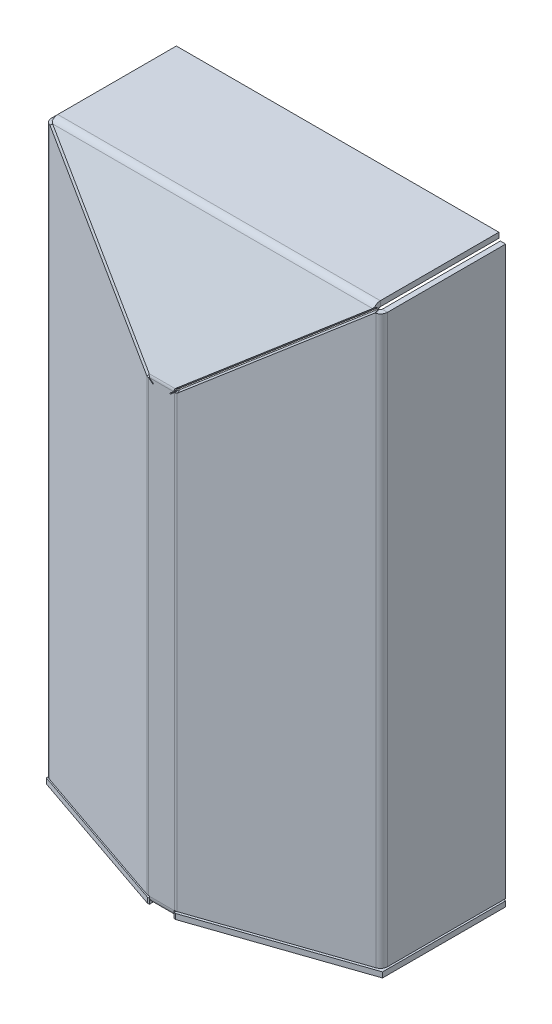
ISO-10303-21;
HEADER;
FILE_DESCRIPTION(('STEP AP214'),'2;1');
FILE_NAME('part.step','',(''),(''),'','','');
FILE_SCHEMA(('AUTOMOTIVE_DESIGN { 1 0 10303 214 1 1 1 1 }'));
ENDSEC;
DATA;
#1=APPLICATION_CONTEXT('core data for automotive mechanical design processes');
#2=APPLICATION_PROTOCOL_DEFINITION('international standard','automotive_design',2000,#1);
#3=PRODUCT_CONTEXT('',#1,'mechanical');
#4=PRODUCT('Part','Part','',(#3));
#5=PRODUCT_RELATED_PRODUCT_CATEGORY('part','',(#4));
#6=PRODUCT_DEFINITION_FORMATION('','',#4);
#7=PRODUCT_DEFINITION_CONTEXT('part definition',#1,'design');
#8=PRODUCT_DEFINITION('design','',#6,#7);
#9=PRODUCT_DEFINITION_SHAPE('','',#8);
#10=(LENGTH_UNIT() NAMED_UNIT(*) SI_UNIT(.MILLI.,.METRE.));
#11=(NAMED_UNIT(*) PLANE_ANGLE_UNIT() SI_UNIT($,.RADIAN.));
#12=(NAMED_UNIT(*) SI_UNIT($,.STERADIAN.) SOLID_ANGLE_UNIT());
#13=UNCERTAINTY_MEASURE_WITH_UNIT(LENGTH_MEASURE(1.E-05),#10,'distance_accuracy_value','');
#14=(GEOMETRIC_REPRESENTATION_CONTEXT(3) GLOBAL_UNCERTAINTY_ASSIGNED_CONTEXT((#13)) GLOBAL_UNIT_ASSIGNED_CONTEXT((#10,
#11,#12)) REPRESENTATION_CONTEXT('',''));
#15=CARTESIAN_POINT('',(0.,0.,0.));
#16=DIRECTION('',(0.,0.,1.));
#17=DIRECTION('',(1.,0.,0.));
#18=AXIS2_PLACEMENT_3D('',#15,#16,#17);
#19=CARTESIAN_POINT('',(-2.42385968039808E-13,-63.4573810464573,-100.));
#20=DIRECTION('',(0.,0.,-1.));
#21=DIRECTION('',(0.,1.,0.));
#22=AXIS2_PLACEMENT_3D('',#19,#20,#21);
#23=PLANE('',#22);
#24=DIRECTION('',(0.,1.,0.));
#25=VECTOR('',#24,1.);
#26=CARTESIAN_POINT('',(3.88047888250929,-63.4573810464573,-100.));
#27=LINE('',#26,#25);
#28=CARTESIAN_POINT('',(3.88047888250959,327.,-100.));
#29=VERTEX_POINT('',#28);
#30=CARTESIAN_POINT('',(3.8804788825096,330.,-100.));
#31=VERTEX_POINT('',#30);
#32=EDGE_CURVE('E1566',#29,#31,#27,.T.);
#33=ORIENTED_EDGE('',*,*,#32,.T.);
#34=DIRECTION('',(-1.,0.,0.));
#35=VECTOR('',#34,1.);
#36=CARTESIAN_POINT('',(0.,330.,-100.));
#37=LINE('',#36,#35);
#38=CARTESIAN_POINT('',(187.119521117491,330.,-99.9999999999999));
#39=VERTEX_POINT('',#38);
#40=EDGE_CURVE('E1553',#39,#31,#37,.T.);
#41=ORIENTED_EDGE('',*,*,#40,.F.);
#42=DIRECTION('',(0.,1.,0.));
#43=VECTOR('',#42,1.);
#44=CARTESIAN_POINT('',(187.11952111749,-63.4573810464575,-100.));
#45=LINE('',#44,#43);
#46=CARTESIAN_POINT('',(187.119521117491,327.,-99.9999999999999));
#47=VERTEX_POINT('',#46);
#48=EDGE_CURVE('E1549',#47,#39,#45,.T.);
#49=ORIENTED_EDGE('',*,*,#48,.F.);
#50=DIRECTION('',(-1.,0.,0.));
#51=VECTOR('',#50,1.);
#52=CARTESIAN_POINT('',(0.,327.,-100.));
#53=LINE('',#52,#51);
#54=EDGE_CURVE('E1564',#47,#29,#53,.T.);
#55=ORIENTED_EDGE('',*,*,#54,.T.);
#56=EDGE_LOOP('',(#33,#41,#49,#55));
#57=FACE_BOUND('',#56,.T.);
#58=ADVANCED_FACE('F33',(#57),#23,.T.);
#59=CARTESIAN_POINT('',(3.88047888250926,-63.4573810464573,0.));
#60=DIRECTION('',(1.,0.,0.));
#61=DIRECTION('',(0.,-1.,0.));
#62=AXIS2_PLACEMENT_3D('',#59,#60,#61);
#63=PLANE('',#62);
#64=DIRECTION('',(0.,0.,-1.));
#65=VECTOR('',#64,1.);
#66=CARTESIAN_POINT('',(3.88047888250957,330.,0.));
#67=LINE('',#66,#65);
#68=CARTESIAN_POINT('',(3.88047888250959,330.,-32.6375846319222));
#69=VERTEX_POINT('',#68);
#70=EDGE_CURVE('E1561',#69,#31,#67,.T.);
#71=ORIENTED_EDGE('',*,*,#70,.T.);
#72=ORIENTED_EDGE('',*,*,#32,.F.);
#73=DIRECTION('',(0.,0.,-1.));
#74=VECTOR('',#73,1.);
#75=CARTESIAN_POINT('',(3.88047888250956,327.,-1.11022302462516E-13));
#76=LINE('',#75,#74);
#77=CARTESIAN_POINT('',(3.88047888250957,327.,-32.6375846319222));
#78=VERTEX_POINT('',#77);
#79=EDGE_CURVE('E11',#78,#29,#76,.T.);
#80=ORIENTED_EDGE('',*,*,#79,.F.);
#81=DIRECTION('',(0.,1.,0.));
#82=VECTOR('',#81,1.);
#83=CARTESIAN_POINT('',(3.88047888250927,-63.4573810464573,-32.6375846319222));
#84=LINE('',#83,#82);
#85=EDGE_CURVE('E1556',#78,#69,#84,.T.);
#86=ORIENTED_EDGE('',*,*,#85,.T.);
#87=EDGE_LOOP('',(#71,#72,#80,#86));
#88=FACE_BOUND('',#87,.T.);
#89=ADVANCED_FACE('F1532',(#88),#63,.F.);
#90=CARTESIAN_POINT('',(0.,330.,-100.));
#91=DIRECTION('',(0.,1.,0.));
#92=DIRECTION('',(0.,0.,1.));
#93=AXIS2_PLACEMENT_3D('',#90,#91,#92);
#94=PLANE('',#93);
#95=DIRECTION('',(-1.,0.,0.));
#96=VECTOR('',#95,1.);
#97=CARTESIAN_POINT('',(3.88047888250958,330.,-32.6375846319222));
#98=LINE('',#97,#96);
#99=CARTESIAN_POINT('',(187.119521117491,330.,-32.6375846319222));
#100=VERTEX_POINT('',#99);
#101=EDGE_CURVE('E490',#100,#69,#98,.T.);
#102=ORIENTED_EDGE('',*,*,#101,.F.);
#103=DIRECTION('',(0.,0.,1.));
#104=VECTOR('',#103,1.);
#105=CARTESIAN_POINT('',(187.119521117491,330.,1.11022302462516E-13));
#106=LINE('',#105,#104);
#107=EDGE_CURVE('E1550',#39,#100,#106,.T.);
#108=ORIENTED_EDGE('',*,*,#107,.F.);
#109=ORIENTED_EDGE('',*,*,#40,.T.);
#110=ORIENTED_EDGE('',*,*,#70,.F.);
#111=EDGE_LOOP('',(#102,#108,#109,#110));
#112=FACE_BOUND('',#111,.T.);
#113=ADVANCED_FACE('F1537',(#112),#94,.T.);
#114=CARTESIAN_POINT('',(187.11952111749,-63.4573810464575,0.));
#115=DIRECTION('',(1.,0.,0.));
#116=DIRECTION('',(0.,-1.,0.));
#117=AXIS2_PLACEMENT_3D('',#114,#115,#116);
#118=PLANE('',#117);
#119=ORIENTED_EDGE('',*,*,#48,.T.);
#120=ORIENTED_EDGE('',*,*,#107,.T.);
#121=DIRECTION('',(0.,1.,0.));
#122=VECTOR('',#121,1.);
#123=CARTESIAN_POINT('',(187.11952111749,-63.4573810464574,-32.6375846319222));
#124=LINE('',#123,#122);
#125=CARTESIAN_POINT('',(187.119521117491,327.,-32.6375846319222));
#126=VERTEX_POINT('',#125);
#127=EDGE_CURVE('E37',#126,#100,#124,.T.);
#128=ORIENTED_EDGE('',*,*,#127,.F.);
#129=DIRECTION('',(0.,0.,1.));
#130=VECTOR('',#129,1.);
#131=CARTESIAN_POINT('',(187.119521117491,327.,1.11022302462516E-13));
#132=LINE('',#131,#130);
#133=EDGE_CURVE('E52',#47,#126,#132,.T.);
#134=ORIENTED_EDGE('',*,*,#133,.F.);
#135=EDGE_LOOP('',(#119,#120,#128,#134));
#136=FACE_BOUND('',#135,.T.);
#137=ADVANCED_FACE('F1542',(#136),#118,.T.);
#138=CARTESIAN_POINT('',(0.,327.,-100.));
#139=DIRECTION('',(0.,1.,0.));
#140=DIRECTION('',(0.,0.,1.));
#141=AXIS2_PLACEMENT_3D('',#138,#139,#140);
#142=PLANE('',#141);
#143=ORIENTED_EDGE('',*,*,#133,.T.);
#144=DIRECTION('',(-1.,0.,0.));
#145=VECTOR('',#144,1.);
#146=CARTESIAN_POINT('',(3.88047888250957,327.,-32.6375846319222));
#147=LINE('',#146,#145);
#148=EDGE_CURVE('E43',#126,#78,#147,.T.);
#149=ORIENTED_EDGE('',*,*,#148,.T.);
#150=ORIENTED_EDGE('',*,*,#79,.T.);
#151=ORIENTED_EDGE('',*,*,#54,.F.);
#152=EDGE_LOOP('',(#143,#149,#150,#151));
#153=FACE_BOUND('',#152,.T.);
#154=ADVANCED_FACE('F35',(#153),#142,.F.);
#155=CARTESIAN_POINT('',(0.692382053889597,175.349882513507,-392.872638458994));
#156=DIRECTION('',(0.656526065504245,0.693314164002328,-0.297134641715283));
#157=DIRECTION('',(-0.754303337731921,0.603442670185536,-0.258618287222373));
#158=AXIS2_PLACEMENT_3D('',#155,#156,#157);
#159=PLANE('',#158);
#160=CARTESIAN_POINT('',(88.1643682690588,260.754646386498,-0.323419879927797));
#161=CARTESIAN_POINT('',(88.1643682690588,259.572888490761,-3.08085496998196));
#162=B_SPLINE_CURVE_WITH_KNOTS('',1,(#160,#161),.UNSPECIFIED.,.F.,.F.,(2,2),(0.,1.),.UNSPECIFIED.);
#163=CARTESIAN_POINT('',(88.1643682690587,259.572888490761,-3.08085496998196));
#164=VERTEX_POINT('',#163);
#165=CARTESIAN_POINT('',(88.1643682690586,260.754646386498,-0.323419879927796));
#166=VERTEX_POINT('',#165);
#167=EDGE_CURVE('E697',#164,#166,#162,.F.);
#168=ORIENTED_EDGE('',*,*,#167,.T.);
#169=DIRECTION('',(-0.754303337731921,0.603442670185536,-0.258618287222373));
#170=VECTOR('',#169,1.);
#171=CARTESIAN_POINT('',(0.692382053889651,330.732235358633,-30.3138151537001));
#172=LINE('',#171,#170);
#173=CARTESIAN_POINT('',(4.63807975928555,327.575677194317,-28.96100451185));
#174=VERTEX_POINT('',#173);
#175=EDGE_CURVE('E695',#166,#174,#172,.T.);
#176=ORIENTED_EDGE('',*,*,#175,.T.);
#177=CARTESIAN_POINT('',(4.63807975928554,326.393919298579,-31.7184396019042));
#178=CARTESIAN_POINT('',(4.63807975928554,327.575677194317,-28.9610045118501));
#179=B_SPLINE_CURVE_WITH_KNOTS('',1,(#177,#178),.UNSPECIFIED.,.F.,.F.,(2,2),(0.,1.),.UNSPECIFIED.);
#180=CARTESIAN_POINT('',(4.63807975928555,326.393919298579,-31.7184396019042));
#181=VERTEX_POINT('',#180);
#182=EDGE_CURVE('E496',#181,#174,#179,.T.);
#183=ORIENTED_EDGE('',*,*,#182,.F.);
#184=DIRECTION('',(-0.754303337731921,0.603442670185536,-0.258618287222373));
#185=VECTOR('',#184,1.);
#186=CARTESIAN_POINT('',(0.692382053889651,329.550477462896,-33.0712502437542));
#187=LINE('',#186,#185);
#188=EDGE_CURVE('E98',#164,#181,#187,.T.);
#189=ORIENTED_EDGE('',*,*,#188,.F.);
#190=EDGE_LOOP('',(#168,#176,#183,#189));
#191=FACE_BOUND('',#190,.T.);
#192=ADVANCED_FACE('F693',(#191),#159,.F.);
#193=CARTESIAN_POINT('',(-0.000999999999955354,330.,-30.));
#194=DIRECTION('',(0.,-0.393919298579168,-0.919145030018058));
#195=DIRECTION('',(0.,0.919145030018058,-0.393919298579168));
#196=AXIS2_PLACEMENT_3D('',#193,#194,#195);
#197=PLANE('',#196);
#198=ORIENTED_EDGE('',*,*,#175,.F.);
#199=DIRECTION('',(1.,0.,0.));
#200=VECTOR('',#199,1.);
#201=CARTESIAN_POINT('',(88.1643682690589,260.754646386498,-0.323419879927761));
#202=LINE('',#201,#200);
#203=CARTESIAN_POINT('',(102.835631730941,260.754646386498,-0.323419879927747));
#204=VERTEX_POINT('',#203);
#205=EDGE_CURVE('E699',#166,#204,#202,.T.);
#206=ORIENTED_EDGE('',*,*,#205,.T.);
#207=DIRECTION('',(-0.754303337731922,-0.603442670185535,0.258618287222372));
#208=VECTOR('',#207,1.);
#209=CARTESIAN_POINT('',(81.632536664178,243.792170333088,6.94621271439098));
#210=LINE('',#209,#208);
#211=CARTESIAN_POINT('',(186.361920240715,327.575677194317,-28.96100451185));
#212=VERTEX_POINT('',#211);
#213=EDGE_CURVE('E644',#212,#204,#210,.T.);
#214=ORIENTED_EDGE('',*,*,#213,.F.);
#215=DIRECTION('',(1.,0.,0.));
#216=VECTOR('',#215,1.);
#217=CARTESIAN_POINT('',(4.63807975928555,327.575677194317,-28.96100451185));
#218=LINE('',#217,#216);
#219=EDGE_CURVE('E682',#174,#212,#218,.T.);
#220=ORIENTED_EDGE('',*,*,#219,.F.);
#221=EDGE_LOOP('',(#198,#206,#214,#220));
#222=FACE_BOUND('',#221,.T.);
#223=ADVANCED_FACE('F672',(#222),#197,.F.);
#224=CARTESIAN_POINT('',(81.632536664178,88.4098174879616,-355.612610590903));
#225=DIRECTION('',(-0.656526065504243,0.693314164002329,-0.297134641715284));
#226=DIRECTION('',(-0.754303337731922,-0.603442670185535,0.258618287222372));
#227=AXIS2_PLACEMENT_3D('',#224,#225,#226);
#228=PLANE('',#227);
#229=CARTESIAN_POINT('',(186.361920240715,327.575677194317,-28.96100451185));
#230=CARTESIAN_POINT('',(186.361920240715,326.393919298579,-31.7184396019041));
#231=B_SPLINE_CURVE_WITH_KNOTS('',1,(#229,#230),.UNSPECIFIED.,.F.,.F.,(2,2),(0.,1.),.UNSPECIFIED.);
#232=CARTESIAN_POINT('',(186.361920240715,326.393919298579,-31.7184396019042));
#233=VERTEX_POINT('',#232);
#234=EDGE_CURVE('E596',#233,#212,#231,.F.);
#235=ORIENTED_EDGE('',*,*,#234,.T.);
#236=ORIENTED_EDGE('',*,*,#213,.T.);
#237=CARTESIAN_POINT('',(102.835631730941,259.572888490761,-3.08085496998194));
#238=CARTESIAN_POINT('',(102.835631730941,260.754646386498,-0.323419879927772));
#239=B_SPLINE_CURVE_WITH_KNOTS('',1,(#237,#238),.UNSPECIFIED.,.F.,.F.,(2,2),(0.,1.),.UNSPECIFIED.);
#240=CARTESIAN_POINT('',(102.835631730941,259.572888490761,-3.08085496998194));
#241=VERTEX_POINT('',#240);
#242=EDGE_CURVE('E689',#241,#204,#239,.T.);
#243=ORIENTED_EDGE('',*,*,#242,.F.);
#244=DIRECTION('',(-0.754303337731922,-0.603442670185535,0.258618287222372));
#245=VECTOR('',#244,1.);
#246=CARTESIAN_POINT('',(81.632536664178,242.61041243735,4.18877762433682));
#247=LINE('',#246,#245);
#248=EDGE_CURVE('E641',#233,#241,#247,.T.);
#249=ORIENTED_EDGE('',*,*,#248,.F.);
#250=EDGE_LOOP('',(#235,#236,#243,#249));
#251=FACE_BOUND('',#250,.T.);
#252=ADVANCED_FACE('F661',(#251),#228,.F.);
#253=CARTESIAN_POINT('',(-0.000999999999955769,328.818242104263,-32.7574350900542));
#254=DIRECTION('',(0.,-0.393919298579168,-0.919145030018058));
#255=DIRECTION('',(0.,0.919145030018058,-0.393919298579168));
#256=AXIS2_PLACEMENT_3D('',#253,#254,#255);
#257=PLANE('',#256);
#258=ORIENTED_EDGE('',*,*,#188,.T.);
#259=DIRECTION('',(1.,0.,0.));
#260=VECTOR('',#259,1.);
#261=CARTESIAN_POINT('',(4.63807975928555,326.393919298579,-31.7184396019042));
#262=LINE('',#261,#260);
#263=EDGE_CURVE('E103',#181,#233,#262,.T.);
#264=ORIENTED_EDGE('',*,*,#263,.T.);
#265=ORIENTED_EDGE('',*,*,#248,.T.);
#266=DIRECTION('',(1.,0.,0.));
#267=VECTOR('',#266,1.);
#268=CARTESIAN_POINT('',(88.1643682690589,259.572888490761,-3.08085496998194));
#269=LINE('',#268,#267);
#270=EDGE_CURVE('E712',#164,#241,#269,.T.);
#271=ORIENTED_EDGE('',*,*,#270,.F.);
#272=EDGE_LOOP('',(#258,#264,#265,#271));
#273=FACE_BOUND('',#272,.T.);
#274=ADVANCED_FACE('F671',(#273),#257,.T.);
#275=CARTESIAN_POINT('',(-469.889763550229,0.,-100.));
#276=DIRECTION('',(0.,0.,-1.));
#277=DIRECTION('',(-1.,0.,0.));
#278=AXIS2_PLACEMENT_3D('',#275,#276,#277);
#279=PLANE('',#278);
#280=DIRECTION('',(1.,0.,0.));
#281=VECTOR('',#280,1.);
#282=CARTESIAN_POINT('',(-469.889763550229,326.11952111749,-100.));
#283=LINE('',#282,#281);
#284=CARTESIAN_POINT('',(188.,326.11952111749,-100.));
#285=VERTEX_POINT('',#284);
#286=CARTESIAN_POINT('',(191.,326.11952111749,-100.));
#287=VERTEX_POINT('',#286);
#288=EDGE_CURVE('E804',#285,#287,#283,.T.);
#289=ORIENTED_EDGE('',*,*,#288,.T.);
#290=DIRECTION('',(0.,1.,0.));
#291=VECTOR('',#290,1.);
#292=CARTESIAN_POINT('',(191.,0.,-100.));
#293=LINE('',#292,#291);
#294=CARTESIAN_POINT('',(191.,4.10000000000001,-100.));
#295=VERTEX_POINT('',#294);
#296=EDGE_CURVE('E795',#295,#287,#293,.T.);
#297=ORIENTED_EDGE('',*,*,#296,.F.);
#298=DIRECTION('',(1.,0.,0.));
#299=VECTOR('',#298,1.);
#300=CARTESIAN_POINT('',(-469.889763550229,4.10000000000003,-100.));
#301=LINE('',#300,#299);
#302=CARTESIAN_POINT('',(188.,4.10000000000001,-100.));
#303=VERTEX_POINT('',#302);
#304=EDGE_CURVE('E793',#303,#295,#301,.T.);
#305=ORIENTED_EDGE('',*,*,#304,.F.);
#306=DIRECTION('',(0.,1.,0.));
#307=VECTOR('',#306,1.);
#308=CARTESIAN_POINT('',(188.,0.,-100.));
#309=LINE('',#308,#307);
#310=EDGE_CURVE('E802',#303,#285,#309,.T.);
#311=ORIENTED_EDGE('',*,*,#310,.T.);
#312=EDGE_LOOP('',(#289,#297,#305,#311));
#313=FACE_BOUND('',#312,.T.);
#314=ADVANCED_FACE('F738',(#313),#279,.T.);
#315=CARTESIAN_POINT('',(-469.889763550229,326.11952111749,0.));
#316=DIRECTION('',(0.,-1.,0.));
#317=DIRECTION('',(-1.,0.,0.));
#318=AXIS2_PLACEMENT_3D('',#315,#316,#317);
#319=PLANE('',#318);
#320=DIRECTION('',(0.,0.,-1.));
#321=VECTOR('',#320,1.);
#322=CARTESIAN_POINT('',(191.,326.11952111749,0.));
#323=LINE('',#322,#321);
#324=CARTESIAN_POINT('',(191.,326.11952111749,-32.8571428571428));
#325=VERTEX_POINT('',#324);
#326=EDGE_CURVE('E799',#325,#287,#323,.T.);
#327=ORIENTED_EDGE('',*,*,#326,.T.);
#328=ORIENTED_EDGE('',*,*,#288,.F.);
#329=DIRECTION('',(0.,0.,-1.));
#330=VECTOR('',#329,1.);
#331=CARTESIAN_POINT('',(188.,326.11952111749,0.));
#332=LINE('',#331,#330);
#333=CARTESIAN_POINT('',(188.,326.11952111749,-32.8571428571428));
#334=VERTEX_POINT('',#333);
#335=EDGE_CURVE('E138',#334,#285,#332,.T.);
#336=ORIENTED_EDGE('',*,*,#335,.F.);
#337=DIRECTION('',(1.,0.,0.));
#338=VECTOR('',#337,1.);
#339=CARTESIAN_POINT('',(-469.889763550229,326.11952111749,-32.8571428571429));
#340=LINE('',#339,#338);
#341=EDGE_CURVE('E797',#334,#325,#340,.T.);
#342=ORIENTED_EDGE('',*,*,#341,.T.);
#343=EDGE_LOOP('',(#327,#328,#336,#342));
#344=FACE_BOUND('',#343,.T.);
#345=ADVANCED_FACE('F734',(#344),#319,.F.);
#346=CARTESIAN_POINT('',(191.,0.,-100.));
#347=DIRECTION('',(1.,0.,0.));
#348=DIRECTION('',(0.,0.,-1.));
#349=AXIS2_PLACEMENT_3D('',#346,#347,#348);
#350=PLANE('',#349);
#351=DIRECTION('',(0.,1.,0.));
#352=VECTOR('',#351,1.);
#353=CARTESIAN_POINT('',(191.,326.119521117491,-32.8571428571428));
#354=LINE('',#353,#352);
#355=CARTESIAN_POINT('',(191.,4.10000000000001,-32.8571428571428));
#356=VERTEX_POINT('',#355);
#357=EDGE_CURVE('E807',#356,#325,#354,.T.);
#358=ORIENTED_EDGE('',*,*,#357,.F.);
#359=DIRECTION('',(0.,0.,1.));
#360=VECTOR('',#359,1.);
#361=CARTESIAN_POINT('',(191.,4.10000000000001,-100.));
#362=LINE('',#361,#360);
#363=EDGE_CURVE('E791',#295,#356,#362,.T.);
#364=ORIENTED_EDGE('',*,*,#363,.F.);
#365=ORIENTED_EDGE('',*,*,#296,.T.);
#366=ORIENTED_EDGE('',*,*,#326,.F.);
#367=EDGE_LOOP('',(#358,#364,#365,#366));
#368=FACE_BOUND('',#367,.T.);
#369=ADVANCED_FACE('F731',(#368),#350,.T.);
#370=CARTESIAN_POINT('',(-469.889763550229,4.10000000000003,-100.));
#371=DIRECTION('',(0.,-1.,0.));
#372=DIRECTION('',(-1.,0.,0.));
#373=AXIS2_PLACEMENT_3D('',#370,#371,#372);
#374=PLANE('',#373);
#375=ORIENTED_EDGE('',*,*,#304,.T.);
#376=ORIENTED_EDGE('',*,*,#363,.T.);
#377=DIRECTION('',(1.,0.,0.));
#378=VECTOR('',#377,1.);
#379=CARTESIAN_POINT('',(-469.889763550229,4.10000000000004,-32.8571428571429));
#380=LINE('',#379,#378);
#381=CARTESIAN_POINT('',(188.,4.10000000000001,-32.8571428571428));
#382=VERTEX_POINT('',#381);
#383=EDGE_CURVE('E131',#382,#356,#380,.T.);
#384=ORIENTED_EDGE('',*,*,#383,.F.);
#385=DIRECTION('',(0.,0.,1.));
#386=VECTOR('',#385,1.);
#387=CARTESIAN_POINT('',(188.,4.10000000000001,-100.));
#388=LINE('',#387,#386);
#389=EDGE_CURVE('E112',#303,#382,#388,.T.);
#390=ORIENTED_EDGE('',*,*,#389,.F.);
#391=EDGE_LOOP('',(#375,#376,#384,#390));
#392=FACE_BOUND('',#391,.T.);
#393=ADVANCED_FACE('F727',(#392),#374,.T.);
#394=CARTESIAN_POINT('',(188.,0.,-100.));
#395=DIRECTION('',(1.,0.,0.));
#396=DIRECTION('',(0.,0.,-1.));
#397=AXIS2_PLACEMENT_3D('',#394,#395,#396);
#398=PLANE('',#397);
#399=ORIENTED_EDGE('',*,*,#389,.T.);
#400=DIRECTION('',(0.,1.,0.));
#401=VECTOR('',#400,1.);
#402=CARTESIAN_POINT('',(188.,326.119521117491,-32.8571428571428));
#403=LINE('',#402,#401);
#404=EDGE_CURVE('E788',#382,#334,#403,.T.);
#405=ORIENTED_EDGE('',*,*,#404,.T.);
#406=ORIENTED_EDGE('',*,*,#335,.T.);
#407=ORIENTED_EDGE('',*,*,#310,.F.);
#408=EDGE_LOOP('',(#399,#405,#406,#407));
#409=FACE_BOUND('',#408,.T.);
#410=ADVANCED_FACE('F722',(#409),#398,.F.);
#411=CARTESIAN_POINT('',(-114.231189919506,326.11952111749,-635.049303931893));
#412=DIRECTION('',(0.,-1.,0.));
#413=DIRECTION('',(-0.324324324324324,0.,-0.945945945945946));
#414=AXIS2_PLACEMENT_3D('',#411,#412,#413);
#415=PLANE('',#414);
#416=DIRECTION('',(0.324324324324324,0.,0.945945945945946));
#417=VECTOR('',#416,1.);
#418=CARTESIAN_POINT('',(-29.7311899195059,326.11952111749,-664.020732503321));
#419=LINE('',#418,#417);
#420=CARTESIAN_POINT('',(187.027027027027,326.11952111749,-31.8092664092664));
#421=VERTEX_POINT('',#420);
#422=CARTESIAN_POINT('',(188.,326.11952111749,-28.9714285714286));
#423=VERTEX_POINT('',#422);
#424=EDGE_CURVE('E165',#421,#423,#419,.T.);
#425=ORIENTED_EDGE('',*,*,#424,.T.);
#426=DIRECTION('',(0.945945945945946,0.,-0.324324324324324));
#427=VECTOR('',#426,1.);
#428=CARTESIAN_POINT('',(103.5,326.11952111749,0.));
#429=LINE('',#428,#427);
#430=CARTESIAN_POINT('',(188.297297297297,326.11952111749,-29.0733590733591));
#431=VERTEX_POINT('',#430);
#432=EDGE_CURVE('E1405',#423,#431,#429,.T.);
#433=ORIENTED_EDGE('',*,*,#432,.T.);
#434=DIRECTION('',(0.324324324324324,0.,0.945945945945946));
#435=VECTOR('',#434,1.);
#436=CARTESIAN_POINT('',(-29.4338926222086,326.11952111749,-664.122663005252));
#437=LINE('',#436,#435);
#438=CARTESIAN_POINT('',(187.324324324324,326.11952111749,-31.9111969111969));
#439=VERTEX_POINT('',#438);
#440=EDGE_CURVE('E1409',#439,#431,#437,.T.);
#441=ORIENTED_EDGE('',*,*,#440,.F.);
#442=DIRECTION('',(0.945945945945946,0.,-0.324324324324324));
#443=VECTOR('',#442,1.);
#444=CARTESIAN_POINT('',(102.527027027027,326.11952111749,-2.83783783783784));
#445=LINE('',#444,#443);
#446=EDGE_CURVE('E1388',#421,#439,#445,.T.);
#447=ORIENTED_EDGE('',*,*,#446,.F.);
#448=EDGE_LOOP('',(#425,#433,#441,#447));
#449=FACE_BOUND('',#448,.T.);
#450=ADVANCED_FACE('F726',(#449),#415,.F.);
#451=CARTESIAN_POINT('',(-141.872221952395,422.847315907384,-625.572378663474));
#452=DIRECTION('',(-0.598019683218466,-0.774811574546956,0.205035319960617));
#453=DIRECTION('',(0.732929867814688,-0.632192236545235,-0.251290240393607));
#454=AXIS2_PLACEMENT_3D('',#451,#452,#453);
#455=PLANE('',#454);
#456=DIRECTION('',(0.324324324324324,0.,0.945945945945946));
#457=VECTOR('',#456,1.);
#458=CARTESIAN_POINT('',(-29.8311392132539,326.205732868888,-663.986464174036));
#459=LINE('',#458,#457);
#460=CARTESIAN_POINT('',(186.927077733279,326.205732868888,-31.7749980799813));
#461=VERTEX_POINT('',#460);
#462=CARTESIAN_POINT('',(187.900050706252,326.205732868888,-28.9371602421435));
#463=VERTEX_POINT('',#462);
#464=EDGE_CURVE('E1401',#461,#463,#459,.T.);
#465=ORIENTED_EDGE('',*,*,#464,.T.);
#466=DIRECTION('',(0.732929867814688,-0.632192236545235,-0.251290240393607));
#467=VECTOR('',#466,1.);
#468=CARTESIAN_POINT('',(75.8589679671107,422.847315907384,9.47692526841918));
#469=LINE('',#468,#467);
#470=EDGE_CURVE('E1399',#463,#423,#469,.T.);
#471=ORIENTED_EDGE('',*,*,#470,.T.);
#472=ORIENTED_EDGE('',*,*,#424,.F.);
#473=DIRECTION('',(0.732929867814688,-0.632192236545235,-0.251290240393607));
#474=VECTOR('',#473,1.);
#475=CARTESIAN_POINT('',(74.8859949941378,422.847315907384,6.63908743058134));
#476=LINE('',#475,#474);
#477=EDGE_CURVE('E777',#461,#421,#476,.T.);
#478=ORIENTED_EDGE('',*,*,#477,.F.);
#479=EDGE_LOOP('',(#465,#471,#472,#478));
#480=FACE_BOUND('',#479,.T.);
#481=ADVANCED_FACE('F759',(#480),#455,.F.);
#482=CARTESIAN_POINT('',(-23.2071953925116,331.504887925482,-666.257530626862));
#483=DIRECTION('',(0.570824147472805,-0.797406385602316,-0.19571113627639));
#484=DIRECTION('',(0.754303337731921,0.603442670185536,-0.258618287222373));
#485=AXIS2_PLACEMENT_3D('',#482,#483,#484);
#486=PLANE('',#485);
#487=CARTESIAN_POINT('',(104.130630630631,259.190196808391,-0.216216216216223));
#488=CARTESIAN_POINT('',(103.157657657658,259.190196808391,-3.05405405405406));
#489=B_SPLINE_CURVE_WITH_KNOTS('',1,(#487,#488),.UNSPECIFIED.,.F.,.F.,(2,2),(0.,1.),.UNSPECIFIED.);
#490=CARTESIAN_POINT('',(103.157657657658,259.190196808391,-3.05405405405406));
#491=VERTEX_POINT('',#490);
#492=CARTESIAN_POINT('',(104.130630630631,259.190196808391,-0.216216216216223));
#493=VERTEX_POINT('',#492);
#494=EDGE_CURVE('E1037',#491,#493,#489,.F.);
#495=ORIENTED_EDGE('',*,*,#494,.T.);
#496=DIRECTION('',(0.754303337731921,0.603442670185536,-0.258618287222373));
#497=VECTOR('',#496,1.);
#498=CARTESIAN_POINT('',(194.523994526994,331.504887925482,-31.2082266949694));
#499=LINE('',#498,#497);
#500=EDGE_CURVE('E1414',#493,#463,#499,.T.);
#501=ORIENTED_EDGE('',*,*,#500,.T.);
#502=ORIENTED_EDGE('',*,*,#464,.F.);
#503=DIRECTION('',(0.754303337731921,0.603442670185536,-0.258618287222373));
#504=VECTOR('',#503,1.);
#505=CARTESIAN_POINT('',(193.551021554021,331.504887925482,-34.0460645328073));
#506=LINE('',#505,#504);
#507=EDGE_CURVE('E769',#491,#461,#506,.T.);
#508=ORIENTED_EDGE('',*,*,#507,.F.);
#509=EDGE_LOOP('',(#495,#501,#502,#508));
#510=FACE_BOUND('',#509,.T.);
#511=ADVANCED_FACE('F754',(#510),#486,.F.);
#512=CARTESIAN_POINT('',(103.5,458.659835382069,0.));
#513=DIRECTION('',(-0.324324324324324,0.,-0.945945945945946));
#514=DIRECTION('',(-0.945945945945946,0.,0.324324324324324));
#515=AXIS2_PLACEMENT_3D('',#512,#513,#514);
#516=PLANE('',#515);
#517=DIRECTION('',(0.,-1.,0.));
#518=VECTOR('',#517,1.);
#519=CARTESIAN_POINT('',(188.297297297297,326.119521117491,-29.073359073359));
#520=LINE('',#519,#518);
#521=CARTESIAN_POINT('',(188.297297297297,4.10000000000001,-29.073359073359));
#522=VERTEX_POINT('',#521);
#523=EDGE_CURVE('E173',#431,#522,#520,.T.);
#524=ORIENTED_EDGE('',*,*,#523,.F.);
#525=ORIENTED_EDGE('',*,*,#432,.F.);
#526=ORIENTED_EDGE('',*,*,#470,.F.);
#527=ORIENTED_EDGE('',*,*,#500,.F.);
#528=DIRECTION('',(0.,-1.,0.));
#529=VECTOR('',#528,1.);
#530=CARTESIAN_POINT('',(104.130630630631,259.190196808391,-0.216216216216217));
#531=LINE('',#530,#529);
#532=CARTESIAN_POINT('',(104.130630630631,4.09999999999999,-0.216216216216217));
#533=VERTEX_POINT('',#532);
#534=EDGE_CURVE('E1398',#493,#533,#531,.T.);
#535=ORIENTED_EDGE('',*,*,#534,.T.);
#536=DIRECTION('',(-0.945945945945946,0.,0.324324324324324));
#537=VECTOR('',#536,1.);
#538=CARTESIAN_POINT('',(103.5,4.09999999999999,0.));
#539=LINE('',#538,#537);
#540=EDGE_CURVE('E778',#522,#533,#539,.T.);
#541=ORIENTED_EDGE('',*,*,#540,.F.);
#542=EDGE_LOOP('',(#524,#525,#526,#527,#535,#541));
#543=FACE_BOUND('',#542,.T.);
#544=ADVANCED_FACE('F750',(#543),#516,.F.);
#545=CARTESIAN_POINT('',(-114.231189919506,4.09999999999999,-635.049303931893));
#546=DIRECTION('',(0.,1.,0.));
#547=DIRECTION('',(-0.945945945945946,0.,0.324324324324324));
#548=AXIS2_PLACEMENT_3D('',#545,#546,#547);
#549=PLANE('',#548);
#550=DIRECTION('',(0.324324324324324,0.,0.945945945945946));
#551=VECTOR('',#550,1.);
#552=CARTESIAN_POINT('',(-29.4338926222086,4.10000000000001,-664.122663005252));
#553=LINE('',#552,#551);
#554=CARTESIAN_POINT('',(187.324324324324,4.09999999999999,-31.9111969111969));
#555=VERTEX_POINT('',#554);
#556=EDGE_CURVE('E1395',#555,#522,#553,.T.);
#557=ORIENTED_EDGE('',*,*,#556,.T.);
#558=ORIENTED_EDGE('',*,*,#540,.T.);
#559=DIRECTION('',(0.324324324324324,0.,0.945945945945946));
#560=VECTOR('',#559,1.);
#561=CARTESIAN_POINT('',(-113.600559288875,4.09999999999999,-635.265520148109));
#562=LINE('',#561,#560);
#563=CARTESIAN_POINT('',(103.157657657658,4.10000000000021,-3.05405405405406));
#564=VERTEX_POINT('',#563);
#565=EDGE_CURVE('E783',#564,#533,#562,.T.);
#566=ORIENTED_EDGE('',*,*,#565,.F.);
#567=DIRECTION('',(-0.945945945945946,0.,0.324324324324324));
#568=VECTOR('',#567,1.);
#569=CARTESIAN_POINT('',(102.527027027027,4.09999999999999,-2.83783783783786));
#570=LINE('',#569,#568);
#571=EDGE_CURVE('E811',#555,#564,#570,.T.);
#572=ORIENTED_EDGE('',*,*,#571,.F.);
#573=EDGE_LOOP('',(#557,#558,#566,#572));
#574=FACE_BOUND('',#573,.T.);
#575=ADVANCED_FACE('F746',(#574),#549,.F.);
#576=CARTESIAN_POINT('',(102.527027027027,458.659835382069,-2.83783783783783));
#577=DIRECTION('',(-0.324324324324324,0.,-0.945945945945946));
#578=DIRECTION('',(-0.945945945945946,0.,0.324324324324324));
#579=AXIS2_PLACEMENT_3D('',#576,#577,#578);
#580=PLANE('',#579);
#581=DIRECTION('',(0.,-1.,0.));
#582=VECTOR('',#581,1.);
#583=CARTESIAN_POINT('',(103.157657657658,259.190196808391,-3.05405405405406));
#584=LINE('',#583,#582);
#585=EDGE_CURVE('E781',#491,#564,#584,.T.);
#586=ORIENTED_EDGE('',*,*,#585,.F.);
#587=ORIENTED_EDGE('',*,*,#507,.T.);
#588=ORIENTED_EDGE('',*,*,#477,.T.);
#589=ORIENTED_EDGE('',*,*,#446,.T.);
#590=DIRECTION('',(0.,-1.,0.));
#591=VECTOR('',#590,1.);
#592=CARTESIAN_POINT('',(187.324324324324,326.119521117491,-31.9111969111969));
#593=LINE('',#592,#591);
#594=EDGE_CURVE('E1385',#439,#555,#593,.T.);
#595=ORIENTED_EDGE('',*,*,#594,.T.);
#596=ORIENTED_EDGE('',*,*,#571,.T.);
#597=EDGE_LOOP('',(#586,#587,#588,#589,#595,#596));
#598=FACE_BOUND('',#597,.T.);
#599=ADVANCED_FACE('F742',(#598),#580,.T.);
#600=CARTESIAN_POINT('',(660.889763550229,0.,-100.));
#601=DIRECTION('',(0.,0.,-1.));
#602=DIRECTION('',(-1.,0.,0.));
#603=AXIS2_PLACEMENT_3D('',#600,#601,#602);
#604=PLANE('',#603);
#605=DIRECTION('',(-1.,0.,0.));
#606=VECTOR('',#605,1.);
#607=CARTESIAN_POINT('',(660.889763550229,4.1,-100.));
#608=LINE('',#607,#606);
#609=CARTESIAN_POINT('',(2.99999999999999,4.09999999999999,-100.));
#610=VERTEX_POINT('',#609);
#611=CARTESIAN_POINT('',(0.,4.09999999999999,-100.));
#612=VERTEX_POINT('',#611);
#613=EDGE_CURVE('E1468',#610,#612,#608,.T.);
#614=ORIENTED_EDGE('',*,*,#613,.T.);
#615=DIRECTION('',(0.,-1.,0.));
#616=VECTOR('',#615,1.);
#617=CARTESIAN_POINT('',(0.,0.,-100.));
#618=LINE('',#617,#616);
#619=CARTESIAN_POINT('',(0.,326.11952111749,-100.));
#620=VERTEX_POINT('',#619);
#621=EDGE_CURVE('E1479',#620,#612,#618,.T.);
#622=ORIENTED_EDGE('',*,*,#621,.F.);
#623=DIRECTION('',(-1.,0.,0.));
#624=VECTOR('',#623,1.);
#625=CARTESIAN_POINT('',(660.889763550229,326.11952111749,-100.));
#626=LINE('',#625,#624);
#627=CARTESIAN_POINT('',(2.99999999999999,326.11952111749,-100.));
#628=VERTEX_POINT('',#627);
#629=EDGE_CURVE('E1481',#628,#620,#626,.T.);
#630=ORIENTED_EDGE('',*,*,#629,.F.);
#631=DIRECTION('',(0.,-1.,0.));
#632=VECTOR('',#631,1.);
#633=CARTESIAN_POINT('',(2.99999999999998,0.,-100.));
#634=LINE('',#633,#632);
#635=EDGE_CURVE('E1471',#628,#610,#634,.T.);
#636=ORIENTED_EDGE('',*,*,#635,.T.);
#637=EDGE_LOOP('',(#614,#622,#630,#636));
#638=FACE_BOUND('',#637,.T.);
#639=ADVANCED_FACE('F745',(#638),#604,.T.);
#640=CARTESIAN_POINT('',(660.889763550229,4.1,-100.));
#641=DIRECTION('',(0.,-1.,0.));
#642=DIRECTION('',(1.,0.,0.));
#643=AXIS2_PLACEMENT_3D('',#640,#641,#642);
#644=PLANE('',#643);
#645=DIRECTION('',(-1.,0.,0.));
#646=VECTOR('',#645,1.);
#647=CARTESIAN_POINT('',(660.889763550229,4.1,-32.8571428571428));
#648=LINE('',#647,#646);
#649=CARTESIAN_POINT('',(2.99999999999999,4.09999999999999,-32.8571428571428));
#650=VERTEX_POINT('',#649);
#651=CARTESIAN_POINT('',(0.,4.09999999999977,-32.8571428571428));
#652=VERTEX_POINT('',#651);
#653=EDGE_CURVE('E1473',#650,#652,#648,.T.);
#654=ORIENTED_EDGE('',*,*,#653,.T.);
#655=DIRECTION('',(0.,0.,-1.));
#656=VECTOR('',#655,1.);
#657=CARTESIAN_POINT('',(0.,4.09999999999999,0.));
#658=LINE('',#657,#656);
#659=EDGE_CURVE('E1475',#652,#612,#658,.T.);
#660=ORIENTED_EDGE('',*,*,#659,.T.);
#661=ORIENTED_EDGE('',*,*,#613,.F.);
#662=DIRECTION('',(0.,0.,1.));
#663=VECTOR('',#662,1.);
#664=CARTESIAN_POINT('',(2.99999999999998,4.09999999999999,-100.));
#665=LINE('',#664,#663);
#666=EDGE_CURVE('E208',#610,#650,#665,.T.);
#667=ORIENTED_EDGE('',*,*,#666,.T.);
#668=EDGE_LOOP('',(#654,#660,#661,#667));
#669=FACE_BOUND('',#668,.T.);
#670=ADVANCED_FACE('F1511',(#669),#644,.T.);
#671=CARTESIAN_POINT('',(0.,0.,-100.));
#672=DIRECTION('',(-1.,0.,0.));
#673=DIRECTION('',(0.,0.,1.));
#674=AXIS2_PLACEMENT_3D('',#671,#672,#673);
#675=PLANE('',#674);
#676=DIRECTION('',(0.,-1.,0.));
#677=VECTOR('',#676,1.);
#678=CARTESIAN_POINT('',(0.,4.09999999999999,-32.8571428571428));
#679=LINE('',#678,#677);
#680=CARTESIAN_POINT('',(0.,326.11952111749,-32.8571428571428));
#681=VERTEX_POINT('',#680);
#682=EDGE_CURVE('E1464',#681,#652,#679,.T.);
#683=ORIENTED_EDGE('',*,*,#682,.F.);
#684=DIRECTION('',(0.,0.,1.));
#685=VECTOR('',#684,1.);
#686=CARTESIAN_POINT('',(0.,326.11952111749,0.));
#687=LINE('',#686,#685);
#688=EDGE_CURVE('E1483',#620,#681,#687,.T.);
#689=ORIENTED_EDGE('',*,*,#688,.F.);
#690=ORIENTED_EDGE('',*,*,#621,.T.);
#691=ORIENTED_EDGE('',*,*,#659,.F.);
#692=EDGE_LOOP('',(#683,#689,#690,#691));
#693=FACE_BOUND('',#692,.T.);
#694=ADVANCED_FACE('F1515',(#693),#675,.T.);
#695=CARTESIAN_POINT('',(660.889763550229,326.11952111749,0.));
#696=DIRECTION('',(0.,1.,0.));
#697=DIRECTION('',(-1.,0.,0.));
#698=AXIS2_PLACEMENT_3D('',#695,#696,#697);
#699=PLANE('',#698);
#700=ORIENTED_EDGE('',*,*,#629,.T.);
#701=ORIENTED_EDGE('',*,*,#688,.T.);
#702=DIRECTION('',(-1.,0.,0.));
#703=VECTOR('',#702,1.);
#704=CARTESIAN_POINT('',(660.889763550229,326.11952111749,-32.8571428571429));
#705=LINE('',#704,#703);
#706=CARTESIAN_POINT('',(2.99999999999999,326.11952111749,-32.8571428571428));
#707=VERTEX_POINT('',#706);
#708=EDGE_CURVE('E201',#707,#681,#705,.T.);
#709=ORIENTED_EDGE('',*,*,#708,.F.);
#710=DIRECTION('',(0.,0.,1.));
#711=VECTOR('',#710,1.);
#712=CARTESIAN_POINT('',(2.99999999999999,326.11952111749,0.));
#713=LINE('',#712,#711);
#714=EDGE_CURVE('E182',#628,#707,#713,.T.);
#715=ORIENTED_EDGE('',*,*,#714,.F.);
#716=EDGE_LOOP('',(#700,#701,#709,#715));
#717=FACE_BOUND('',#716,.T.);
#718=ADVANCED_FACE('F1518',(#717),#699,.T.);
#719=CARTESIAN_POINT('',(2.99999999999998,0.,-100.));
#720=DIRECTION('',(-1.,0.,0.));
#721=DIRECTION('',(0.,0.,1.));
#722=AXIS2_PLACEMENT_3D('',#719,#720,#721);
#723=PLANE('',#722);
#724=ORIENTED_EDGE('',*,*,#714,.T.);
#725=DIRECTION('',(0.,-1.,0.));
#726=VECTOR('',#725,1.);
#727=CARTESIAN_POINT('',(2.99999999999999,4.09999999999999,-32.8571428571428));
#728=LINE('',#727,#726);
#729=EDGE_CURVE('E784',#707,#650,#728,.T.);
#730=ORIENTED_EDGE('',*,*,#729,.T.);
#731=ORIENTED_EDGE('',*,*,#666,.F.);
#732=ORIENTED_EDGE('',*,*,#635,.F.);
#733=EDGE_LOOP('',(#724,#730,#731,#732));
#734=FACE_BOUND('',#733,.T.);
#735=ADVANCED_FACE('F1522',(#734),#723,.F.);
#736=CARTESIAN_POINT('',(305.231189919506,326.11952111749,-635.049303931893));
#737=DIRECTION('',(0.,-1.,0.));
#738=DIRECTION('',(0.324324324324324,0.,-0.945945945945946));
#739=AXIS2_PLACEMENT_3D('',#736,#737,#738);
#740=PLANE('',#739);
#741=DIRECTION('',(-0.324324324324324,0.,0.945945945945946));
#742=VECTOR('',#741,1.);
#743=CARTESIAN_POINT('',(220.433892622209,326.11952111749,-664.122663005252));
#744=LINE('',#743,#742);
#745=CARTESIAN_POINT('',(3.67567567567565,326.11952111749,-31.9111969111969));
#746=VERTEX_POINT('',#745);
#747=CARTESIAN_POINT('',(2.7027027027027,326.11952111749,-29.0733590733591));
#748=VERTEX_POINT('',#747);
#749=EDGE_CURVE('E1741',#746,#748,#744,.T.);
#750=ORIENTED_EDGE('',*,*,#749,.T.);
#751=DIRECTION('',(0.945945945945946,0.,0.324324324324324));
#752=VECTOR('',#751,1.);
#753=CARTESIAN_POINT('',(87.5,326.11952111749,0.));
#754=LINE('',#753,#752);
#755=CARTESIAN_POINT('',(3.00000000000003,326.11952111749,-28.9714285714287));
#756=VERTEX_POINT('',#755);
#757=EDGE_CURVE('E242',#748,#756,#754,.T.);
#758=ORIENTED_EDGE('',*,*,#757,.T.);
#759=DIRECTION('',(-0.324324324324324,0.,0.945945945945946));
#760=VECTOR('',#759,1.);
#761=CARTESIAN_POINT('',(220.731189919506,326.11952111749,-664.020732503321));
#762=LINE('',#761,#760);
#763=CARTESIAN_POINT('',(3.97297297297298,326.11952111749,-31.8092664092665));
#764=VERTEX_POINT('',#763);
#765=EDGE_CURVE('E1738',#764,#756,#762,.T.);
#766=ORIENTED_EDGE('',*,*,#765,.F.);
#767=DIRECTION('',(0.945945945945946,0.,0.324324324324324));
#768=VECTOR('',#767,1.);
#769=CARTESIAN_POINT('',(88.4729729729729,326.11952111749,-2.83783783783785));
#770=LINE('',#769,#768);
#771=EDGE_CURVE('E1754',#746,#764,#770,.T.);
#772=ORIENTED_EDGE('',*,*,#771,.F.);
#773=EDGE_LOOP('',(#750,#758,#766,#772));
#774=FACE_BOUND('',#773,.T.);
#775=ADVANCED_FACE('F1524',(#774),#740,.F.);
#776=CARTESIAN_POINT('',(332.872221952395,422.847315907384,-625.572378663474));
#777=DIRECTION('',(0.598019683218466,-0.774811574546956,0.205035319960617));
#778=DIRECTION('',(0.732929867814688,0.632192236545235,0.251290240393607));
#779=AXIS2_PLACEMENT_3D('',#776,#777,#778);
#780=PLANE('',#779);
#781=ORIENTED_EDGE('',*,*,#765,.T.);
#782=DIRECTION('',(0.732929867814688,0.632192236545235,0.251290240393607));
#783=VECTOR('',#782,1.);
#784=CARTESIAN_POINT('',(115.141032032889,422.847315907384,9.47692526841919));
#785=LINE('',#784,#783);
#786=CARTESIAN_POINT('',(3.09994929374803,326.205732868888,-28.9371602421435));
#787=VERTEX_POINT('',#786);
#788=EDGE_CURVE('E235',#756,#787,#785,.T.);
#789=ORIENTED_EDGE('',*,*,#788,.T.);
#790=DIRECTION('',(-0.324324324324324,0.,0.945945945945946));
#791=VECTOR('',#790,1.);
#792=CARTESIAN_POINT('',(220.831139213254,326.205732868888,-663.986464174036));
#793=LINE('',#792,#791);
#794=CARTESIAN_POINT('',(4.07292226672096,326.205732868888,-31.7749980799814));
#795=VERTEX_POINT('',#794);
#796=EDGE_CURVE('E1730',#795,#787,#793,.T.);
#797=ORIENTED_EDGE('',*,*,#796,.F.);
#798=DIRECTION('',(0.732929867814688,0.632192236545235,0.251290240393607));
#799=VECTOR('',#798,1.);
#800=CARTESIAN_POINT('',(116.114005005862,422.847315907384,6.63908743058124));
#801=LINE('',#800,#799);
#802=EDGE_CURVE('E217',#764,#795,#801,.T.);
#803=ORIENTED_EDGE('',*,*,#802,.F.);
#804=EDGE_LOOP('',(#781,#789,#797,#803));
#805=FACE_BOUND('',#804,.T.);
#806=ADVANCED_FACE('F1706',(#805),#780,.F.);
#807=CARTESIAN_POINT('',(305.231189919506,4.09999999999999,-635.049303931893));
#808=DIRECTION('',(0.,1.,0.));
#809=DIRECTION('',(-0.324324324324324,0.,0.945945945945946));
#810=AXIS2_PLACEMENT_3D('',#807,#808,#809);
#811=PLANE('',#810);
#812=DIRECTION('',(-0.324324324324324,0.,0.945945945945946));
#813=VECTOR('',#812,1.);
#814=CARTESIAN_POINT('',(304.600559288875,4.09999999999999,-635.265520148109));
#815=LINE('',#814,#813);
#816=CARTESIAN_POINT('',(87.8423423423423,4.09999999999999,-3.05405405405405));
#817=VERTEX_POINT('',#816);
#818=CARTESIAN_POINT('',(86.8693693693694,4.09999999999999,-0.216216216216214));
#819=VERTEX_POINT('',#818);
#820=EDGE_CURVE('E1717',#817,#819,#815,.T.);
#821=ORIENTED_EDGE('',*,*,#820,.T.);
#822=DIRECTION('',(-0.945945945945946,0.,-0.324324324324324));
#823=VECTOR('',#822,1.);
#824=CARTESIAN_POINT('',(87.5,4.09999999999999,0.));
#825=LINE('',#824,#823);
#826=CARTESIAN_POINT('',(2.7027027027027,4.09999999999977,-29.0733590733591));
#827=VERTEX_POINT('',#826);
#828=EDGE_CURVE('E1720',#819,#827,#825,.T.);
#829=ORIENTED_EDGE('',*,*,#828,.T.);
#830=DIRECTION('',(-0.324324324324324,0.,0.945945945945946));
#831=VECTOR('',#830,1.);
#832=CARTESIAN_POINT('',(220.433892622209,4.09999999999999,-664.122663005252));
#833=LINE('',#832,#831);
#834=CARTESIAN_POINT('',(3.67567567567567,4.09999999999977,-31.9111969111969));
#835=VERTEX_POINT('',#834);
#836=EDGE_CURVE('E1724',#835,#827,#833,.T.);
#837=ORIENTED_EDGE('',*,*,#836,.F.);
#838=DIRECTION('',(-0.945945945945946,0.,-0.324324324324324));
#839=VECTOR('',#838,1.);
#840=CARTESIAN_POINT('',(88.472972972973,4.09999999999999,-2.83783783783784));
#841=LINE('',#840,#839);
#842=EDGE_CURVE('E1723',#817,#835,#841,.T.);
#843=ORIENTED_EDGE('',*,*,#842,.F.);
#844=EDGE_LOOP('',(#821,#829,#837,#843));
#845=FACE_BOUND('',#844,.T.);
#846=ADVANCED_FACE('F1708',(#845),#811,.F.);
#847=CARTESIAN_POINT('',(87.5,458.659835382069,0.));
#848=DIRECTION('',(0.324324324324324,0.,-0.945945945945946));
#849=DIRECTION('',(-0.945945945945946,0.,-0.324324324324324));
#850=AXIS2_PLACEMENT_3D('',#847,#848,#849);
#851=PLANE('',#850);
#852=DIRECTION('',(0.,1.,0.));
#853=VECTOR('',#852,1.);
#854=CARTESIAN_POINT('',(2.7027027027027,4.09999999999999,-29.0733590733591));
#855=LINE('',#854,#853);
#856=EDGE_CURVE('E1728',#827,#748,#855,.T.);
#857=ORIENTED_EDGE('',*,*,#856,.F.);
#858=ORIENTED_EDGE('',*,*,#828,.F.);
#859=DIRECTION('',(0.,1.,0.));
#860=VECTOR('',#859,1.);
#861=CARTESIAN_POINT('',(86.8693693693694,4.09999999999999,-0.21621621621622));
#862=LINE('',#861,#860);
#863=CARTESIAN_POINT('',(86.8693693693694,259.190196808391,-0.21621621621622));
#864=VERTEX_POINT('',#863);
#865=EDGE_CURVE('E1628',#819,#864,#862,.T.);
#866=ORIENTED_EDGE('',*,*,#865,.T.);
#867=DIRECTION('',(0.754303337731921,-0.603442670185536,0.258618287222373));
#868=VECTOR('',#867,1.);
#869=CARTESIAN_POINT('',(-3.52399452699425,331.504887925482,-31.2082266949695));
#870=LINE('',#869,#868);
#871=EDGE_CURVE('E1746',#787,#864,#870,.T.);
#872=ORIENTED_EDGE('',*,*,#871,.F.);
#873=ORIENTED_EDGE('',*,*,#788,.F.);
#874=ORIENTED_EDGE('',*,*,#757,.F.);
#875=EDGE_LOOP('',(#857,#858,#866,#872,#873,#874));
#876=FACE_BOUND('',#875,.T.);
#877=ADVANCED_FACE('F1504',(#876),#851,.F.);
#878=CARTESIAN_POINT('',(214.207195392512,331.504887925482,-666.257530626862));
#879=DIRECTION('',(-0.570824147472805,-0.797406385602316,-0.19571113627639));
#880=DIRECTION('',(0.754303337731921,-0.603442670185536,0.258618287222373));
#881=AXIS2_PLACEMENT_3D('',#878,#879,#880);
#882=PLANE('',#881);
#883=ORIENTED_EDGE('',*,*,#796,.T.);
#884=ORIENTED_EDGE('',*,*,#871,.T.);
#885=CARTESIAN_POINT('',(87.8423423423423,259.190196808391,-3.05405405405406));
#886=CARTESIAN_POINT('',(86.8693693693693,259.190196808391,-0.216216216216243));
#887=B_SPLINE_CURVE_WITH_KNOTS('',1,(#885,#886),.UNSPECIFIED.,.F.,.F.,(2,2),(0.,1.),.UNSPECIFIED.);
#888=CARTESIAN_POINT('',(87.8423423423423,259.190196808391,-3.05405405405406));
#889=VERTEX_POINT('',#888);
#890=EDGE_CURVE('E1742',#889,#864,#887,.T.);
#891=ORIENTED_EDGE('',*,*,#890,.F.);
#892=DIRECTION('',(0.754303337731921,-0.603442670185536,0.258618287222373));
#893=VECTOR('',#892,1.);
#894=CARTESIAN_POINT('',(-2.55102155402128,331.504887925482,-34.0460645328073));
#895=LINE('',#894,#893);
#896=EDGE_CURVE('E1465',#795,#889,#895,.T.);
#897=ORIENTED_EDGE('',*,*,#896,.F.);
#898=EDGE_LOOP('',(#883,#884,#891,#897));
#899=FACE_BOUND('',#898,.T.);
#900=ADVANCED_FACE('F1493',(#899),#882,.F.);
#901=CARTESIAN_POINT('',(88.472972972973,458.659835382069,-2.83783783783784));
#902=DIRECTION('',(0.324324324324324,0.,-0.945945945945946));
#903=DIRECTION('',(-0.945945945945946,0.,-0.324324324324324));
#904=AXIS2_PLACEMENT_3D('',#901,#902,#903);
#905=PLANE('',#904);
#906=ORIENTED_EDGE('',*,*,#842,.T.);
#907=DIRECTION('',(0.,1.,0.));
#908=VECTOR('',#907,1.);
#909=CARTESIAN_POINT('',(3.67567567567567,4.09999999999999,-31.9111969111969));
#910=LINE('',#909,#908);
#911=EDGE_CURVE('E1756',#835,#746,#910,.T.);
#912=ORIENTED_EDGE('',*,*,#911,.T.);
#913=ORIENTED_EDGE('',*,*,#771,.T.);
#914=ORIENTED_EDGE('',*,*,#802,.T.);
#915=ORIENTED_EDGE('',*,*,#896,.T.);
#916=DIRECTION('',(0.,1.,0.));
#917=VECTOR('',#916,1.);
#918=CARTESIAN_POINT('',(87.8423423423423,4.09999999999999,-3.05405405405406));
#919=LINE('',#918,#917);
#920=EDGE_CURVE('E1317',#817,#889,#919,.T.);
#921=ORIENTED_EDGE('',*,*,#920,.F.);
#922=EDGE_LOOP('',(#906,#912,#913,#914,#915,#921));
#923=FACE_BOUND('',#922,.T.);
#924=ADVANCED_FACE('F1503',(#923),#905,.T.);
#925=CARTESIAN_POINT('',(88.4999999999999,3.,-4.));
#926=DIRECTION('',(1.,0.,0.));
#927=DIRECTION('',(0.,1.,0.));
#928=AXIS2_PLACEMENT_3D('',#925,#926,#927);
#929=PLANE('',#928);
#930=DIRECTION('',(0.,0.,1.));
#931=VECTOR('',#930,1.);
#932=CARTESIAN_POINT('',(88.4999999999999,0.,0.0269908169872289));
#933=LINE('',#932,#931);
#934=CARTESIAN_POINT('',(88.4999999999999,0.,-4.00000000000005));
#935=VERTEX_POINT('',#934);
#936=CARTESIAN_POINT('',(88.4999999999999,0.,0.));
#937=VERTEX_POINT('',#936);
#938=EDGE_CURVE('E1313',#935,#937,#933,.T.);
#939=ORIENTED_EDGE('',*,*,#938,.F.);
#940=CARTESIAN_POINT('',(88.4999999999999,4.,-4.));
#941=DIRECTION('',(-1.,0.,0.));
#942=DIRECTION('',(0.,0.,1.));
#943=AXIS2_PLACEMENT_3D('',#940,#941,#942);
#944=CIRCLE('',#943,4.);
#945=CARTESIAN_POINT('',(88.4999999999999,3.,-0.12701665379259));
#946=VERTEX_POINT('',#945);
#947=EDGE_CURVE('E1169',#935,#946,#944,.T.);
#948=ORIENTED_EDGE('',*,*,#947,.T.);
#949=DIRECTION('',(0.,0.,1.));
#950=VECTOR('',#949,1.);
#951=CARTESIAN_POINT('',(88.5,3.00000000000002,325.926990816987));
#952=LINE('',#951,#950);
#953=CARTESIAN_POINT('',(88.4999999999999,3.,0.));
#954=VERTEX_POINT('',#953);
#955=EDGE_CURVE('E257',#946,#954,#952,.T.);
#956=ORIENTED_EDGE('',*,*,#955,.T.);
#957=DIRECTION('',(0.,-1.,0.));
#958=VECTOR('',#957,1.);
#959=CARTESIAN_POINT('',(88.4999999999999,3.,0.));
#960=LINE('',#959,#958);
#961=EDGE_CURVE('E1251',#954,#937,#960,.T.);
#962=ORIENTED_EDGE('',*,*,#961,.T.);
#963=EDGE_LOOP('',(#939,#948,#956,#962));
#964=FACE_BOUND('',#963,.T.);
#965=ADVANCED_FACE('F1363',(#964),#929,.T.);
#966=CARTESIAN_POINT('',(102.5,3.,0.));
#967=DIRECTION('',(-1.,0.,0.));
#968=DIRECTION('',(0.,-1.,0.));
#969=AXIS2_PLACEMENT_3D('',#966,#967,#968);
#970=PLANE('',#969);
#971=CARTESIAN_POINT('',(102.5,4.,-4.));
#972=DIRECTION('',(-1.,0.,0.));
#973=DIRECTION('',(0.,0.,1.));
#974=AXIS2_PLACEMENT_3D('',#971,#972,#973);
#975=CIRCLE('',#974,4.);
#976=CARTESIAN_POINT('',(102.5,0.,-4.00000000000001));
#977=VERTEX_POINT('',#976);
#978=CARTESIAN_POINT('',(102.5,3.,-0.12701665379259));
#979=VERTEX_POINT('',#978);
#980=EDGE_CURVE('E1160',#977,#979,#975,.T.);
#981=ORIENTED_EDGE('',*,*,#980,.F.);
#982=DIRECTION('',(0.,0.,1.));
#983=VECTOR('',#982,1.);
#984=CARTESIAN_POINT('',(102.5,0.,0.));
#985=LINE('',#984,#983);
#986=CARTESIAN_POINT('',(102.5,0.,0.));
#987=VERTEX_POINT('',#986);
#988=EDGE_CURVE('E1272',#977,#987,#985,.T.);
#989=ORIENTED_EDGE('',*,*,#988,.T.);
#990=DIRECTION('',(0.,-1.,0.));
#991=VECTOR('',#990,1.);
#992=CARTESIAN_POINT('',(102.5,3.,0.));
#993=LINE('',#992,#991);
#994=CARTESIAN_POINT('',(102.5,3.,0.));
#995=VERTEX_POINT('',#994);
#996=EDGE_CURVE('E1250',#995,#987,#993,.T.);
#997=ORIENTED_EDGE('',*,*,#996,.F.);
#998=DIRECTION('',(0.,0.,1.));
#999=VECTOR('',#998,1.);
#1000=CARTESIAN_POINT('',(102.5,3.,0.0269908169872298));
#1001=LINE('',#1000,#999);
#1002=EDGE_CURVE('E1291',#979,#995,#1001,.T.);
#1003=ORIENTED_EDGE('',*,*,#1002,.F.);
#1004=EDGE_LOOP('',(#981,#989,#997,#1003));
#1005=FACE_BOUND('',#1004,.T.);
#1006=ADVANCED_FACE('F1662',(#1005),#970,.T.);
#1007=CARTESIAN_POINT('',(191.,434.189053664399,0.));
#1008=DIRECTION('',(0.,0.,-1.));
#1009=DIRECTION('',(0.,1.,0.));
#1010=AXIS2_PLACEMENT_3D('',#1007,#1008,#1009);
#1011=PLANE('',#1010);
#1012=DIRECTION('',(1.,0.,0.));
#1013=VECTOR('',#1012,1.);
#1014=CARTESIAN_POINT('',(0.,0.,0.));
#1015=LINE('',#1014,#1013);
#1016=CARTESIAN_POINT('',(103.5,0.,0.));
#1017=VERTEX_POINT('',#1016);
#1018=EDGE_CURVE('E1256',#987,#1017,#1015,.T.);
#1019=ORIENTED_EDGE('',*,*,#1018,.T.);
#1020=DIRECTION('',(0.,-1.,0.));
#1021=VECTOR('',#1020,1.);
#1022=CARTESIAN_POINT('',(103.5,434.189053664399,0.));
#1023=LINE('',#1022,#1021);
#1024=CARTESIAN_POINT('',(103.5,3.,0.));
#1025=VERTEX_POINT('',#1024);
#1026=EDGE_CURVE('E1310',#1025,#1017,#1023,.T.);
#1027=ORIENTED_EDGE('',*,*,#1026,.F.);
#1028=DIRECTION('',(1.,0.,0.));
#1029=VECTOR('',#1028,1.);
#1030=CARTESIAN_POINT('',(191.,3.,0.));
#1031=LINE('',#1030,#1029);
#1032=EDGE_CURVE('E1287',#995,#1025,#1031,.T.);
#1033=ORIENTED_EDGE('',*,*,#1032,.F.);
#1034=ORIENTED_EDGE('',*,*,#996,.T.);
#1035=EDGE_LOOP('',(#1019,#1027,#1033,#1034));
#1036=FACE_BOUND('',#1035,.T.);
#1037=ADVANCED_FACE('F1665',(#1036),#1011,.F.);
#1038=CARTESIAN_POINT('',(103.5,434.189053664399,0.));
#1039=DIRECTION('',(-0.324324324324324,0.,-0.945945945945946));
#1040=DIRECTION('',(0.945945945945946,0.,-0.324324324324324));
#1041=AXIS2_PLACEMENT_3D('',#1038,#1039,#1040);
#1042=PLANE('',#1041);
#1043=DIRECTION('',(0.945945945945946,0.,-0.324324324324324));
#1044=VECTOR('',#1043,1.);
#1045=CARTESIAN_POINT('',(103.5,0.,0.));
#1046=LINE('',#1045,#1044);
#1047=CARTESIAN_POINT('',(191.,0.,-30.));
#1048=VERTEX_POINT('',#1047);
#1049=EDGE_CURVE('E1254',#1017,#1048,#1046,.T.);
#1050=ORIENTED_EDGE('',*,*,#1049,.T.);
#1051=DIRECTION('',(0.,-1.,0.));
#1052=VECTOR('',#1051,1.);
#1053=CARTESIAN_POINT('',(191.,434.189053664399,-30.));
#1054=LINE('',#1053,#1052);
#1055=CARTESIAN_POINT('',(191.,3.,-30.));
#1056=VERTEX_POINT('',#1055);
#1057=EDGE_CURVE('E1307',#1056,#1048,#1054,.T.);
#1058=ORIENTED_EDGE('',*,*,#1057,.F.);
#1059=DIRECTION('',(0.945945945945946,0.,-0.324324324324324));
#1060=VECTOR('',#1059,1.);
#1061=CARTESIAN_POINT('',(103.5,3.,0.));
#1062=LINE('',#1061,#1060);
#1063=EDGE_CURVE('E1289',#1025,#1056,#1062,.T.);
#1064=ORIENTED_EDGE('',*,*,#1063,.F.);
#1065=ORIENTED_EDGE('',*,*,#1026,.T.);
#1066=EDGE_LOOP('',(#1050,#1058,#1064,#1065));
#1067=FACE_BOUND('',#1066,.T.);
#1068=ADVANCED_FACE('F1670',(#1067),#1042,.F.);
#1069=CARTESIAN_POINT('',(191.,434.189053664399,0.));
#1070=DIRECTION('',(-1.,0.,0.));
#1071=DIRECTION('',(0.,-1.,0.));
#1072=AXIS2_PLACEMENT_3D('',#1069,#1070,#1071);
#1073=PLANE('',#1072);
#1074=DIRECTION('',(0.,0.,1.));
#1075=VECTOR('',#1074,1.);
#1076=CARTESIAN_POINT('',(191.,0.,-100.));
#1077=LINE('',#1076,#1075);
#1078=CARTESIAN_POINT('',(191.,0.,-100.));
#1079=VERTEX_POINT('',#1078);
#1080=EDGE_CURVE('E1267',#1079,#1048,#1077,.T.);
#1081=ORIENTED_EDGE('',*,*,#1080,.F.);
#1082=DIRECTION('',(0.,-1.,0.));
#1083=VECTOR('',#1082,1.);
#1084=CARTESIAN_POINT('',(191.,434.189053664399,-100.));
#1085=LINE('',#1084,#1083);
#1086=CARTESIAN_POINT('',(191.,3.,-100.));
#1087=VERTEX_POINT('',#1086);
#1088=EDGE_CURVE('E1304',#1087,#1079,#1085,.T.);
#1089=ORIENTED_EDGE('',*,*,#1088,.F.);
#1090=DIRECTION('',(0.,0.,-1.));
#1091=VECTOR('',#1090,1.);
#1092=CARTESIAN_POINT('',(191.,3.,0.));
#1093=LINE('',#1092,#1091);
#1094=EDGE_CURVE('E1275',#1056,#1087,#1093,.T.);
#1095=ORIENTED_EDGE('',*,*,#1094,.F.);
#1096=ORIENTED_EDGE('',*,*,#1057,.T.);
#1097=EDGE_LOOP('',(#1081,#1089,#1095,#1096));
#1098=FACE_BOUND('',#1097,.T.);
#1099=ADVANCED_FACE('F1674',(#1098),#1073,.F.);
#1100=CARTESIAN_POINT('',(0.,434.189053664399,-100.));
#1101=DIRECTION('',(0.,0.,-1.));
#1102=DIRECTION('',(0.,1.,0.));
#1103=AXIS2_PLACEMENT_3D('',#1100,#1101,#1102);
#1104=PLANE('',#1103);
#1105=ORIENTED_EDGE('',*,*,#1088,.T.);
#1106=DIRECTION('',(1.,0.,0.));
#1107=VECTOR('',#1106,1.);
#1108=CARTESIAN_POINT('',(0.,0.,-100.));
#1109=LINE('',#1108,#1107);
#1110=CARTESIAN_POINT('',(0.,0.,-100.));
#1111=VERTEX_POINT('',#1110);
#1112=EDGE_CURVE('E1264',#1111,#1079,#1109,.T.);
#1113=ORIENTED_EDGE('',*,*,#1112,.F.);
#1114=DIRECTION('',(0.,-1.,0.));
#1115=VECTOR('',#1114,1.);
#1116=CARTESIAN_POINT('',(0.,434.189053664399,-100.));
#1117=LINE('',#1116,#1115);
#1118=CARTESIAN_POINT('',(0.,3.,-100.));
#1119=VERTEX_POINT('',#1118);
#1120=EDGE_CURVE('E1301',#1119,#1111,#1117,.T.);
#1121=ORIENTED_EDGE('',*,*,#1120,.F.);
#1122=DIRECTION('',(1.,0.,0.));
#1123=VECTOR('',#1122,1.);
#1124=CARTESIAN_POINT('',(0.,3.,-100.));
#1125=LINE('',#1124,#1123);
#1126=EDGE_CURVE('E1277',#1119,#1087,#1125,.T.);
#1127=ORIENTED_EDGE('',*,*,#1126,.T.);
#1128=EDGE_LOOP('',(#1105,#1113,#1121,#1127));
#1129=FACE_BOUND('',#1128,.T.);
#1130=ADVANCED_FACE('F1678',(#1129),#1104,.T.);
#1131=CARTESIAN_POINT('',(0.,434.189053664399,0.));
#1132=DIRECTION('',(-1.,0.,0.));
#1133=DIRECTION('',(0.,-1.,0.));
#1134=AXIS2_PLACEMENT_3D('',#1131,#1132,#1133);
#1135=PLANE('',#1134);
#1136=ORIENTED_EDGE('',*,*,#1120,.T.);
#1137=DIRECTION('',(0.,0.,1.));
#1138=VECTOR('',#1137,1.);
#1139=CARTESIAN_POINT('',(0.,0.,-100.));
#1140=LINE('',#1139,#1138);
#1141=CARTESIAN_POINT('',(0.,0.,-30.));
#1142=VERTEX_POINT('',#1141);
#1143=EDGE_CURVE('E1262',#1111,#1142,#1140,.T.);
#1144=ORIENTED_EDGE('',*,*,#1143,.T.);
#1145=DIRECTION('',(0.,-1.,0.));
#1146=VECTOR('',#1145,1.);
#1147=CARTESIAN_POINT('',(0.,434.189053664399,-30.));
#1148=LINE('',#1147,#1146);
#1149=CARTESIAN_POINT('',(0.,3.,-30.));
#1150=VERTEX_POINT('',#1149);
#1151=EDGE_CURVE('E1298',#1150,#1142,#1148,.T.);
#1152=ORIENTED_EDGE('',*,*,#1151,.F.);
#1153=DIRECTION('',(0.,0.,-1.));
#1154=VECTOR('',#1153,1.);
#1155=CARTESIAN_POINT('',(0.,3.,0.));
#1156=LINE('',#1155,#1154);
#1157=EDGE_CURVE('E1280',#1150,#1119,#1156,.T.);
#1158=ORIENTED_EDGE('',*,*,#1157,.T.);
#1159=EDGE_LOOP('',(#1136,#1144,#1152,#1158));
#1160=FACE_BOUND('',#1159,.T.);
#1161=ADVANCED_FACE('F1681',(#1160),#1135,.T.);
#1162=CARTESIAN_POINT('',(87.5,434.189053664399,0.));
#1163=DIRECTION('',(0.324324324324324,0.,-0.945945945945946));
#1164=DIRECTION('',(0.945945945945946,0.,0.324324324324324));
#1165=AXIS2_PLACEMENT_3D('',#1162,#1163,#1164);
#1166=PLANE('',#1165);
#1167=DIRECTION('',(0.945945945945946,0.,0.324324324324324));
#1168=VECTOR('',#1167,1.);
#1169=CARTESIAN_POINT('',(87.5,0.,0.));
#1170=LINE('',#1169,#1168);
#1171=CARTESIAN_POINT('',(87.5,0.,0.));
#1172=VERTEX_POINT('',#1171);
#1173=EDGE_CURVE('E1260',#1142,#1172,#1170,.T.);
#1174=ORIENTED_EDGE('',*,*,#1173,.T.);
#1175=DIRECTION('',(0.,-1.,0.));
#1176=VECTOR('',#1175,1.);
#1177=CARTESIAN_POINT('',(87.5,434.189053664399,0.));
#1178=LINE('',#1177,#1176);
#1179=CARTESIAN_POINT('',(87.5,3.,0.));
#1180=VERTEX_POINT('',#1179);
#1181=EDGE_CURVE('E1295',#1180,#1172,#1178,.T.);
#1182=ORIENTED_EDGE('',*,*,#1181,.F.);
#1183=DIRECTION('',(0.945945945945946,0.,0.324324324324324));
#1184=VECTOR('',#1183,1.);
#1185=CARTESIAN_POINT('',(87.5,3.,0.));
#1186=LINE('',#1185,#1184);
#1187=EDGE_CURVE('E1283',#1150,#1180,#1186,.T.);
#1188=ORIENTED_EDGE('',*,*,#1187,.F.);
#1189=ORIENTED_EDGE('',*,*,#1151,.T.);
#1190=EDGE_LOOP('',(#1174,#1182,#1188,#1189));
#1191=FACE_BOUND('',#1190,.T.);
#1192=ADVANCED_FACE('F1685',(#1191),#1166,.F.);
#1193=CARTESIAN_POINT('',(0.,434.189053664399,0.));
#1194=DIRECTION('',(0.,0.,-1.));
#1195=DIRECTION('',(0.,1.,0.));
#1196=AXIS2_PLACEMENT_3D('',#1193,#1194,#1195);
#1197=PLANE('',#1196);
#1198=EDGE_CURVE('E1257',#1172,#937,#1015,.T.);
#1199=ORIENTED_EDGE('',*,*,#1198,.T.);
#1200=ORIENTED_EDGE('',*,*,#961,.F.);
#1201=DIRECTION('',(1.,0.,0.));
#1202=VECTOR('',#1201,1.);
#1203=CARTESIAN_POINT('',(0.,3.,0.));
#1204=LINE('',#1203,#1202);
#1205=EDGE_CURVE('E1285',#1180,#954,#1204,.T.);
#1206=ORIENTED_EDGE('',*,*,#1205,.F.);
#1207=ORIENTED_EDGE('',*,*,#1181,.T.);
#1208=EDGE_LOOP('',(#1199,#1200,#1206,#1207));
#1209=FACE_BOUND('',#1208,.T.);
#1210=ADVANCED_FACE('F1652',(#1209),#1197,.F.);
#1211=CARTESIAN_POINT('',(0.,3.,-100.));
#1212=DIRECTION('',(0.,-1.,0.));
#1213=DIRECTION('',(0.,0.,-1.));
#1214=AXIS2_PLACEMENT_3D('',#1211,#1212,#1213);
#1215=PLANE('',#1214);
#1216=DIRECTION('',(-1.,0.,0.));
#1217=VECTOR('',#1216,1.);
#1218=CARTESIAN_POINT('',(102.5,3.,-4.));
#1219=LINE('',#1218,#1217);
#1220=CARTESIAN_POINT('',(102.5,3.,-4.00000000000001));
#1221=VERTEX_POINT('',#1220);
#1222=CARTESIAN_POINT('',(88.4999999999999,3.,-4.00000000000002));
#1223=VERTEX_POINT('',#1222);
#1224=EDGE_CURVE('E1248',#1221,#1223,#1219,.T.);
#1225=ORIENTED_EDGE('',*,*,#1224,.F.);
#1226=EDGE_CURVE('E1292',#1221,#979,#1001,.T.);
#1227=ORIENTED_EDGE('',*,*,#1226,.T.);
#1228=ORIENTED_EDGE('',*,*,#1002,.T.);
#1229=ORIENTED_EDGE('',*,*,#1032,.T.);
#1230=ORIENTED_EDGE('',*,*,#1063,.T.);
#1231=ORIENTED_EDGE('',*,*,#1094,.T.);
#1232=ORIENTED_EDGE('',*,*,#1126,.F.);
#1233=ORIENTED_EDGE('',*,*,#1157,.F.);
#1234=ORIENTED_EDGE('',*,*,#1187,.T.);
#1235=ORIENTED_EDGE('',*,*,#1205,.T.);
#1236=ORIENTED_EDGE('',*,*,#955,.F.);
#1237=EDGE_CURVE('E1315',#1223,#946,#952,.T.);
#1238=ORIENTED_EDGE('',*,*,#1237,.F.);
#1239=EDGE_LOOP('',(#1225,#1227,#1228,#1229,#1230,#1231,#1232,#1233,#1234,#1235,#1236,#1238));
#1240=FACE_BOUND('',#1239,.T.);
#1241=ADVANCED_FACE('F1644',(#1240),#1215,.F.);
#1242=CARTESIAN_POINT('',(0.,0.,-100.));
#1243=DIRECTION('',(0.,-1.,0.));
#1244=DIRECTION('',(0.,0.,-1.));
#1245=AXIS2_PLACEMENT_3D('',#1242,#1243,#1244);
#1246=PLANE('',#1245);
#1247=ORIENTED_EDGE('',*,*,#988,.F.);
#1248=DIRECTION('',(1.,0.,0.));
#1249=VECTOR('',#1248,1.);
#1250=CARTESIAN_POINT('',(102.5,0.,-4.00000000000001));
#1251=LINE('',#1250,#1249);
#1252=EDGE_CURVE('E1270',#935,#977,#1251,.T.);
#1253=ORIENTED_EDGE('',*,*,#1252,.F.);
#1254=ORIENTED_EDGE('',*,*,#938,.T.);
#1255=ORIENTED_EDGE('',*,*,#1198,.F.);
#1256=ORIENTED_EDGE('',*,*,#1173,.F.);
#1257=ORIENTED_EDGE('',*,*,#1143,.F.);
#1258=ORIENTED_EDGE('',*,*,#1112,.T.);
#1259=ORIENTED_EDGE('',*,*,#1080,.T.);
#1260=ORIENTED_EDGE('',*,*,#1049,.F.);
#1261=ORIENTED_EDGE('',*,*,#1018,.F.);
#1262=EDGE_LOOP('',(#1247,#1253,#1254,#1255,#1256,#1257,#1258,#1259,#1260,#1261));
#1263=FACE_BOUND('',#1262,.T.);
#1264=ADVANCED_FACE('F1658',(#1263),#1246,.T.);
#1265=CARTESIAN_POINT('',(102.5,4.,-4.));
#1266=DIRECTION('',(1.,0.,0.));
#1267=DIRECTION('',(0.,0.,-1.));
#1268=AXIS2_PLACEMENT_3D('',#1265,#1266,#1267);
#1269=PLANE('',#1268);
#1270=ORIENTED_EDGE('',*,*,#1226,.F.);
#1271=CARTESIAN_POINT('',(102.5,4.,-4.));
#1272=DIRECTION('',(-1.,0.,0.));
#1273=DIRECTION('',(0.,0.,1.));
#1274=AXIS2_PLACEMENT_3D('',#1271,#1272,#1273);
#1275=CIRCLE('',#1274,1.);
#1276=CARTESIAN_POINT('',(102.5,4.,-3.));
#1277=VERTEX_POINT('',#1276);
#1278=EDGE_CURVE('E1174',#1221,#1277,#1275,.T.);
#1279=ORIENTED_EDGE('',*,*,#1278,.T.);
#1280=DIRECTION('',(0.,0.,1.));
#1281=VECTOR('',#1280,1.);
#1282=CARTESIAN_POINT('',(102.5,4.,-3.));
#1283=LINE('',#1282,#1281);
#1284=CARTESIAN_POINT('',(102.5,4.00000000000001,0.));
#1285=VERTEX_POINT('',#1284);
#1286=EDGE_CURVE('E1181',#1277,#1285,#1283,.T.);
#1287=ORIENTED_EDGE('',*,*,#1286,.T.);
#1288=EDGE_CURVE('E1168',#979,#1285,#975,.T.);
#1289=ORIENTED_EDGE('',*,*,#1288,.F.);
#1290=EDGE_LOOP('',(#1270,#1279,#1287,#1289));
#1291=FACE_BOUND('',#1290,.T.);
#1292=ADVANCED_FACE('F1354',(#1291),#1269,.T.);
#1293=CARTESIAN_POINT('',(102.5,330.,-514.200224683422));
#1294=DIRECTION('',(-1.,0.,0.));
#1295=DIRECTION('',(0.,0.,1.));
#1296=AXIS2_PLACEMENT_3D('',#1293,#1294,#1295);
#1297=PLANE('',#1296);
#1298=DIRECTION('',(0.,-1.,0.));
#1299=VECTOR('',#1298,1.);
#1300=CARTESIAN_POINT('',(102.5,4.09999999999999,0.));
#1301=LINE('',#1300,#1299);
#1302=CARTESIAN_POINT('',(102.5,4.09999999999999,0.));
#1303=VERTEX_POINT('',#1302);
#1304=EDGE_CURVE('E815',#1303,#1285,#1301,.T.);
#1305=ORIENTED_EDGE('',*,*,#1304,.T.);
#1306=ORIENTED_EDGE('',*,*,#1286,.F.);
#1307=DIRECTION('',(0.,-1.,0.));
#1308=VECTOR('',#1307,1.);
#1309=CARTESIAN_POINT('',(102.5,330.,-3.));
#1310=LINE('',#1309,#1308);
#1311=CARTESIAN_POINT('',(102.5,4.09999999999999,-3.));
#1312=VERTEX_POINT('',#1311);
#1313=EDGE_CURVE('E1207',#1312,#1277,#1310,.T.);
#1314=ORIENTED_EDGE('',*,*,#1313,.F.);
#1315=DIRECTION('',(0.,0.,1.));
#1316=VECTOR('',#1315,1.);
#1317=CARTESIAN_POINT('',(102.5,4.09999999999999,-514.200224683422));
#1318=LINE('',#1317,#1316);
#1319=EDGE_CURVE('E1242',#1312,#1303,#1318,.T.);
#1320=ORIENTED_EDGE('',*,*,#1319,.T.);
#1321=EDGE_LOOP('',(#1305,#1306,#1314,#1320));
#1322=FACE_BOUND('',#1321,.T.);
#1323=ADVANCED_FACE('F1350',(#1322),#1297,.F.);
#1324=CARTESIAN_POINT('',(88.4999999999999,330.,-514.200224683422));
#1325=DIRECTION('',(1.,0.,0.));
#1326=DIRECTION('',(0.,0.,-1.));
#1327=AXIS2_PLACEMENT_3D('',#1324,#1325,#1326);
#1328=PLANE('',#1327);
#1329=DIRECTION('',(0.,1.,0.));
#1330=VECTOR('',#1329,1.);
#1331=CARTESIAN_POINT('',(88.4999999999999,330.,-3.));
#1332=LINE('',#1331,#1330);
#1333=CARTESIAN_POINT('',(88.4999999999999,4.,-3.));
#1334=VERTEX_POINT('',#1333);
#1335=CARTESIAN_POINT('',(88.4999999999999,4.09999999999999,-3.));
#1336=VERTEX_POINT('',#1335);
#1337=EDGE_CURVE('E1210',#1334,#1336,#1332,.T.);
#1338=ORIENTED_EDGE('',*,*,#1337,.F.);
#1339=DIRECTION('',(0.,0.,1.));
#1340=VECTOR('',#1339,1.);
#1341=CARTESIAN_POINT('',(88.4999999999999,4.,-3.));
#1342=LINE('',#1341,#1340);
#1343=CARTESIAN_POINT('',(88.4999999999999,4.00000000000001,0.));
#1344=VERTEX_POINT('',#1343);
#1345=EDGE_CURVE('E1171',#1334,#1344,#1342,.T.);
#1346=ORIENTED_EDGE('',*,*,#1345,.T.);
#1347=DIRECTION('',(0.,1.,0.));
#1348=VECTOR('',#1347,1.);
#1349=CARTESIAN_POINT('',(88.4999999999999,4.09999999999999,0.));
#1350=LINE('',#1349,#1348);
#1351=CARTESIAN_POINT('',(88.4999999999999,4.09999999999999,0.));
#1352=VERTEX_POINT('',#1351);
#1353=EDGE_CURVE('E1197',#1344,#1352,#1350,.T.);
#1354=ORIENTED_EDGE('',*,*,#1353,.T.);
#1355=DIRECTION('',(0.,0.,1.));
#1356=VECTOR('',#1355,1.);
#1357=CARTESIAN_POINT('',(88.4999999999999,4.09999999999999,-514.200224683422));
#1358=LINE('',#1357,#1356);
#1359=EDGE_CURVE('E1239',#1336,#1352,#1358,.T.);
#1360=ORIENTED_EDGE('',*,*,#1359,.F.);
#1361=EDGE_LOOP('',(#1338,#1346,#1354,#1360));
#1362=FACE_BOUND('',#1361,.T.);
#1363=ADVANCED_FACE('F1346',(#1362),#1328,.F.);
#1364=CARTESIAN_POINT('',(74.7980143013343,236.502482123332,-514.200224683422));
#1365=DIRECTION('',(0.624695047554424,-0.780868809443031,0.));
#1366=DIRECTION('',(0.78086880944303,0.624695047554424,0.));
#1367=AXIS2_PLACEMENT_3D('',#1364,#1365,#1366);
#1368=PLANE('',#1367);
#1369=DIRECTION('',(0.,0.,1.));
#1370=VECTOR('',#1369,1.);
#1371=CARTESIAN_POINT('',(100.412152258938,256.993792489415,-514.200224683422));
#1372=LINE('',#1371,#1370);
#1373=CARTESIAN_POINT('',(100.412152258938,256.993792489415,-3.));
#1374=VERTEX_POINT('',#1373);
#1375=CARTESIAN_POINT('',(100.412152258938,256.993792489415,0.));
#1376=VERTEX_POINT('',#1375);
#1377=EDGE_CURVE('E1224',#1374,#1376,#1372,.T.);
#1378=ORIENTED_EDGE('',*,*,#1377,.T.);
#1379=DIRECTION('',(0.780868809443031,0.624695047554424,0.));
#1380=VECTOR('',#1379,1.);
#1381=CARTESIAN_POINT('',(187.431868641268,326.609565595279,0.));
#1382=LINE('',#1381,#1380);
#1383=CARTESIAN_POINT('',(102.833333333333,258.930737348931,0.));
#1384=VERTEX_POINT('',#1383);
#1385=EDGE_CURVE('E1188',#1376,#1384,#1382,.T.);
#1386=ORIENTED_EDGE('',*,*,#1385,.T.);
#1387=CARTESIAN_POINT('',(102.833333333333,258.930737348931,-3.));
#1388=CARTESIAN_POINT('',(102.833333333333,258.930737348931,0.));
#1389=B_SPLINE_CURVE_WITH_KNOTS('',1,(#1387,#1388),.UNSPECIFIED.,.F.,.F.,(2,2),(0.,1.),.UNSPECIFIED.);
#1390=CARTESIAN_POINT('',(102.833333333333,258.930737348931,-3.));
#1391=VERTEX_POINT('',#1390);
#1392=EDGE_CURVE('E1048',#1391,#1384,#1389,.T.);
#1393=ORIENTED_EDGE('',*,*,#1392,.F.);
#1394=DIRECTION('',(0.780868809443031,0.624695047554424,0.));
#1395=VECTOR('',#1394,1.);
#1396=CARTESIAN_POINT('',(74.7980143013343,236.502482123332,-3.));
#1397=LINE('',#1396,#1395);
#1398=EDGE_CURVE('E1223',#1374,#1391,#1397,.T.);
#1399=ORIENTED_EDGE('',*,*,#1398,.F.);
#1400=EDGE_LOOP('',(#1378,#1386,#1393,#1399));
#1401=FACE_BOUND('',#1400,.T.);
#1402=ADVANCED_FACE('F1349',(#1401),#1368,.F.);
#1403=CARTESIAN_POINT('',(0.,4.09999999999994,-514.200224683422));
#1404=DIRECTION('',(0.,1.,0.));
#1405=DIRECTION('',(-1.,0.,0.));
#1406=AXIS2_PLACEMENT_3D('',#1403,#1404,#1405);
#1407=PLANE('',#1406);
#1408=DIRECTION('',(0.,0.,1.));
#1409=VECTOR('',#1408,1.);
#1410=CARTESIAN_POINT('',(102.833333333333,4.09999999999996,-514.200224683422));
#1411=LINE('',#1410,#1409);
#1412=CARTESIAN_POINT('',(102.833333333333,4.10000000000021,-3.));
#1413=VERTEX_POINT('',#1412);
#1414=CARTESIAN_POINT('',(102.833333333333,4.09999999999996,0.));
#1415=VERTEX_POINT('',#1414);
#1416=EDGE_CURVE('E1245',#1413,#1415,#1411,.T.);
#1417=ORIENTED_EDGE('',*,*,#1416,.T.);
#1418=DIRECTION('',(-1.,0.,0.));
#1419=VECTOR('',#1418,1.);
#1420=CARTESIAN_POINT('',(191.,4.10000000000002,0.));
#1421=LINE('',#1420,#1419);
#1422=EDGE_CURVE('E1180',#1415,#1303,#1421,.T.);
#1423=ORIENTED_EDGE('',*,*,#1422,.T.);
#1424=ORIENTED_EDGE('',*,*,#1319,.F.);
#1425=DIRECTION('',(-1.,0.,0.));
#1426=VECTOR('',#1425,1.);
#1427=CARTESIAN_POINT('',(0.,4.09999999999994,-3.));
#1428=LINE('',#1427,#1426);
#1429=EDGE_CURVE('E1204',#1413,#1312,#1428,.T.);
#1430=ORIENTED_EDGE('',*,*,#1429,.F.);
#1431=EDGE_LOOP('',(#1417,#1423,#1424,#1430));
#1432=FACE_BOUND('',#1431,.T.);
#1433=ADVANCED_FACE('F1344',(#1432),#1407,.F.);
#1434=CARTESIAN_POINT('',(0.,4.09999999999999,-514.200224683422));
#1435=DIRECTION('',(0.,1.,0.));
#1436=DIRECTION('',(0.,0.,1.));
#1437=AXIS2_PLACEMENT_3D('',#1434,#1435,#1436);
#1438=PLANE('',#1437);
#1439=ORIENTED_EDGE('',*,*,#1359,.T.);
#1440=DIRECTION('',(-1.,0.,0.));
#1441=VECTOR('',#1440,1.);
#1442=CARTESIAN_POINT('',(0.,4.09999999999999,0.));
#1443=LINE('',#1442,#1441);
#1444=CARTESIAN_POINT('',(88.1666666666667,4.09999999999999,0.));
#1445=VERTEX_POINT('',#1444);
#1446=EDGE_CURVE('E1194',#1352,#1445,#1443,.T.);
#1447=ORIENTED_EDGE('',*,*,#1446,.T.);
#1448=DIRECTION('',(0.,0.,1.));
#1449=VECTOR('',#1448,1.);
#1450=CARTESIAN_POINT('',(88.1666666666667,4.09999999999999,-514.200224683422));
#1451=LINE('',#1450,#1449);
#1452=CARTESIAN_POINT('',(88.1666666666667,4.09999999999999,-3.));
#1453=VERTEX_POINT('',#1452);
#1454=EDGE_CURVE('E1237',#1453,#1445,#1451,.T.);
#1455=ORIENTED_EDGE('',*,*,#1454,.F.);
#1456=DIRECTION('',(-1.,0.,0.));
#1457=VECTOR('',#1456,1.);
#1458=CARTESIAN_POINT('',(0.,4.09999999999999,-3.));
#1459=LINE('',#1458,#1457);
#1460=EDGE_CURVE('E1212',#1336,#1453,#1459,.T.);
#1461=ORIENTED_EDGE('',*,*,#1460,.F.);
#1462=EDGE_LOOP('',(#1439,#1447,#1455,#1461));
#1463=FACE_BOUND('',#1462,.T.);
#1464=ADVANCED_FACE('F1341',(#1463),#1438,.F.);
#1465=CARTESIAN_POINT('',(-0.261428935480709,329.673213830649,-514.200224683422));
#1466=DIRECTION('',(-0.624695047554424,-0.780868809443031,0.));
#1467=DIRECTION('',(0.78086880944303,-0.624695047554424,0.));
#1468=AXIS2_PLACEMENT_3D('',#1465,#1466,#1467);
#1469=PLANE('',#1468);
#1470=CARTESIAN_POINT('',(88.1666666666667,258.930737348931,0.));
#1471=CARTESIAN_POINT('',(88.1666666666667,258.930737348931,-3.));
#1472=B_SPLINE_CURVE_WITH_KNOTS('',1,(#1470,#1471),.UNSPECIFIED.,.F.,.F.,(2,2),(0.,1.),.UNSPECIFIED.);
#1473=CARTESIAN_POINT('',(88.1666666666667,258.930737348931,-3.));
#1474=VERTEX_POINT('',#1473);
#1475=CARTESIAN_POINT('',(88.1666666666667,258.930737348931,0.));
#1476=VERTEX_POINT('',#1475);
#1477=EDGE_CURVE('E1156',#1474,#1476,#1472,.F.);
#1478=ORIENTED_EDGE('',*,*,#1477,.T.);
#1479=DIRECTION('',(0.780868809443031,-0.624695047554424,0.));
#1480=VECTOR('',#1479,1.);
#1481=CARTESIAN_POINT('',(3.56813135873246,326.609565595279,0.));
#1482=LINE('',#1481,#1480);
#1483=CARTESIAN_POINT('',(90.5878477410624,256.993792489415,0.));
#1484=VERTEX_POINT('',#1483);
#1485=EDGE_CURVE('E1193',#1476,#1484,#1482,.T.);
#1486=ORIENTED_EDGE('',*,*,#1485,.T.);
#1487=DIRECTION('',(0.,0.,1.));
#1488=VECTOR('',#1487,1.);
#1489=CARTESIAN_POINT('',(90.5878477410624,256.993792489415,-514.200224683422));
#1490=LINE('',#1489,#1488);
#1491=CARTESIAN_POINT('',(90.5878477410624,256.993792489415,-3.));
#1492=VERTEX_POINT('',#1491);
#1493=EDGE_CURVE('E1234',#1492,#1484,#1490,.T.);
#1494=ORIENTED_EDGE('',*,*,#1493,.F.);
#1495=DIRECTION('',(0.780868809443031,-0.624695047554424,0.));
#1496=VECTOR('',#1495,1.);
#1497=CARTESIAN_POINT('',(-0.261428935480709,329.673213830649,-3.));
#1498=LINE('',#1497,#1496);
#1499=EDGE_CURVE('E1215',#1474,#1492,#1498,.T.);
#1500=ORIENTED_EDGE('',*,*,#1499,.F.);
#1501=EDGE_LOOP('',(#1478,#1486,#1494,#1500));
#1502=FACE_BOUND('',#1501,.T.);
#1503=ADVANCED_FACE('F1332',(#1502),#1469,.F.);
#1504=CARTESIAN_POINT('',(90.8492766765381,257.320578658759,-514.200224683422));
#1505=DIRECTION('',(0.780868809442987,-0.624695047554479,0.));
#1506=DIRECTION('',(0.624695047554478,0.780868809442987,0.));
#1507=AXIS2_PLACEMENT_3D('',#1504,#1505,#1506);
#1508=PLANE('',#1507);
#1509=ORIENTED_EDGE('',*,*,#1493,.T.);
#1510=DIRECTION('',(0.624695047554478,0.780868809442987,0.));
#1511=VECTOR('',#1510,1.);
#1512=CARTESIAN_POINT('',(90.9001952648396,257.384226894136,0.));
#1513=LINE('',#1512,#1511);
#1514=CARTESIAN_POINT('',(90.9001952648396,257.384226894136,0.));
#1515=VERTEX_POINT('',#1514);
#1516=EDGE_CURVE('E869',#1484,#1515,#1513,.T.);
#1517=ORIENTED_EDGE('',*,*,#1516,.T.);
#1518=DIRECTION('',(0.,0.,1.));
#1519=VECTOR('',#1518,1.);
#1520=CARTESIAN_POINT('',(90.9001952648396,257.384226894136,-514.200224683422));
#1521=LINE('',#1520,#1519);
#1522=CARTESIAN_POINT('',(90.9001952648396,257.384226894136,-3.));
#1523=VERTEX_POINT('',#1522);
#1524=EDGE_CURVE('E1231',#1523,#1515,#1521,.T.);
#1525=ORIENTED_EDGE('',*,*,#1524,.F.);
#1526=DIRECTION('',(0.624695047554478,0.780868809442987,0.));
#1527=VECTOR('',#1526,1.);
#1528=CARTESIAN_POINT('',(90.8492766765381,257.320578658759,-3.));
#1529=LINE('',#1528,#1527);
#1530=EDGE_CURVE('E1216',#1492,#1523,#1529,.T.);
#1531=ORIENTED_EDGE('',*,*,#1530,.F.);
#1532=EDGE_LOOP('',(#1509,#1517,#1525,#1531));
#1533=FACE_BOUND('',#1532,.T.);
#1534=ADVANCED_FACE('F852',(#1533),#1508,.F.);
#1535=CARTESIAN_POINT('',(0.0509185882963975,330.06364823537,-514.200224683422));
#1536=DIRECTION('',(0.624695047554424,0.780868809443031,0.));
#1537=DIRECTION('',(-0.780868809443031,0.624695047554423,0.));
#1538=AXIS2_PLACEMENT_3D('',#1535,#1536,#1537);
#1539=PLANE('',#1538);
#1540=ORIENTED_EDGE('',*,*,#1524,.T.);
#1541=DIRECTION('',(-0.780868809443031,0.624695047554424,0.));
#1542=VECTOR('',#1541,1.);
#1543=CARTESIAN_POINT('',(3.88047888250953,327.,0.));
#1544=LINE('',#1543,#1542);
#1545=CARTESIAN_POINT('',(88.6567673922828,259.178969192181,0.));
#1546=VERTEX_POINT('',#1545);
#1547=EDGE_CURVE('E821',#1515,#1546,#1544,.T.);
#1548=ORIENTED_EDGE('',*,*,#1547,.T.);
#1549=CARTESIAN_POINT('',(88.6567673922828,259.178969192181,-3.00000000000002));
#1550=CARTESIAN_POINT('',(88.6567673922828,259.178969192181,0.));
#1551=B_SPLINE_CURVE_WITH_KNOTS('',1,(#1549,#1550),.UNSPECIFIED.,.F.,.F.,(2,2),(0.,1.),.UNSPECIFIED.);
#1552=CARTESIAN_POINT('',(88.6567673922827,259.178969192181,-3.00000000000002));
#1553=VERTEX_POINT('',#1552);
#1554=EDGE_CURVE('E884',#1553,#1546,#1551,.T.);
#1555=ORIENTED_EDGE('',*,*,#1554,.F.);
#1556=DIRECTION('',(-0.780868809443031,0.624695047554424,0.));
#1557=VECTOR('',#1556,1.);
#1558=CARTESIAN_POINT('',(0.0509185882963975,330.06364823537,-3.));
#1559=LINE('',#1558,#1557);
#1560=EDGE_CURVE('E1219',#1523,#1553,#1559,.T.);
#1561=ORIENTED_EDGE('',*,*,#1560,.F.);
#1562=EDGE_LOOP('',(#1540,#1548,#1555,#1561));
#1563=FACE_BOUND('',#1562,.T.);
#1564=ADVANCED_FACE('F847',(#1563),#1539,.F.);
#1565=CARTESIAN_POINT('',(74.4856667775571,236.892916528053,-514.200224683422));
#1566=DIRECTION('',(-0.624695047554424,0.780868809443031,0.));
#1567=DIRECTION('',(-0.780868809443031,-0.624695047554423,0.));
#1568=AXIS2_PLACEMENT_3D('',#1565,#1566,#1567);
#1569=PLANE('',#1568);
#1570=CARTESIAN_POINT('',(102.343232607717,259.178969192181,0.));
#1571=CARTESIAN_POINT('',(102.343232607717,259.178969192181,-3.));
#1572=B_SPLINE_CURVE_WITH_KNOTS('',1,(#1570,#1571),.UNSPECIFIED.,.F.,.F.,(2,2),(0.,1.),.UNSPECIFIED.);
#1573=CARTESIAN_POINT('',(102.343232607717,259.178969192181,-3.));
#1574=VERTEX_POINT('',#1573);
#1575=CARTESIAN_POINT('',(102.343232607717,259.178969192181,0.));
#1576=VERTEX_POINT('',#1575);
#1577=EDGE_CURVE('E829',#1574,#1576,#1572,.F.);
#1578=ORIENTED_EDGE('',*,*,#1577,.T.);
#1579=DIRECTION('',(-0.780868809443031,-0.624695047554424,0.));
#1580=VECTOR('',#1579,1.);
#1581=CARTESIAN_POINT('',(187.119521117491,327.,0.));
#1582=LINE('',#1581,#1580);
#1583=CARTESIAN_POINT('',(100.09980473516,257.384226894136,0.));
#1584=VERTEX_POINT('',#1583);
#1585=EDGE_CURVE('E818',#1576,#1584,#1582,.T.);
#1586=ORIENTED_EDGE('',*,*,#1585,.T.);
#1587=DIRECTION('',(0.,0.,1.));
#1588=VECTOR('',#1587,1.);
#1589=CARTESIAN_POINT('',(100.09980473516,257.384226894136,-514.200224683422));
#1590=LINE('',#1589,#1588);
#1591=CARTESIAN_POINT('',(100.09980473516,257.384226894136,-3.));
#1592=VERTEX_POINT('',#1591);
#1593=EDGE_CURVE('E1227',#1592,#1584,#1590,.T.);
#1594=ORIENTED_EDGE('',*,*,#1593,.F.);
#1595=DIRECTION('',(-0.780868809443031,-0.624695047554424,0.));
#1596=VECTOR('',#1595,1.);
#1597=CARTESIAN_POINT('',(74.4856667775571,236.892916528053,-3.));
#1598=LINE('',#1597,#1596);
#1599=EDGE_CURVE('E834',#1574,#1592,#1598,.T.);
#1600=ORIENTED_EDGE('',*,*,#1599,.F.);
#1601=EDGE_LOOP('',(#1578,#1586,#1594,#1600));
#1602=FACE_BOUND('',#1601,.T.);
#1603=ADVANCED_FACE('F836',(#1602),#1569,.F.);
#1604=CARTESIAN_POINT('',(25.6141379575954,350.491310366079,-514.200224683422));
#1605=DIRECTION('',(-0.780868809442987,-0.624695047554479,0.));
#1606=DIRECTION('',(0.624695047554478,-0.780868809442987,0.));
#1607=AXIS2_PLACEMENT_3D('',#1604,#1605,#1606);
#1608=PLANE('',#1607);
#1609=ORIENTED_EDGE('',*,*,#1593,.T.);
#1610=DIRECTION('',(0.624695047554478,-0.780868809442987,0.));
#1611=VECTOR('',#1610,1.);
#1612=CARTESIAN_POINT('',(100.09980473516,257.384226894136,0.));
#1613=LINE('',#1612,#1611);
#1614=EDGE_CURVE('E822',#1584,#1376,#1613,.T.);
#1615=ORIENTED_EDGE('',*,*,#1614,.T.);
#1616=ORIENTED_EDGE('',*,*,#1377,.F.);
#1617=DIRECTION('',(0.624695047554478,-0.780868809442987,0.));
#1618=VECTOR('',#1617,1.);
#1619=CARTESIAN_POINT('',(25.6141379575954,350.491310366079,-3.));
#1620=LINE('',#1619,#1618);
#1621=EDGE_CURVE('E1220',#1592,#1374,#1620,.T.);
#1622=ORIENTED_EDGE('',*,*,#1621,.F.);
#1623=EDGE_LOOP('',(#1609,#1615,#1616,#1622));
#1624=FACE_BOUND('',#1623,.T.);
#1625=ADVANCED_FACE('F846',(#1624),#1608,.F.);
#1626=CARTESIAN_POINT('',(0.,330.,-3.));
#1627=DIRECTION('',(0.,0.,-1.));
#1628=DIRECTION('',(-1.,0.,0.));
#1629=AXIS2_PLACEMENT_3D('',#1626,#1627,#1628);
#1630=PLANE('',#1629);
#1631=ORIENTED_EDGE('',*,*,#1398,.T.);
#1632=DIRECTION('',(0.,-1.,0.));
#1633=VECTOR('',#1632,1.);
#1634=CARTESIAN_POINT('',(102.833333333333,258.930737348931,-3.));
#1635=LINE('',#1634,#1633);
#1636=EDGE_CURVE('E1228',#1391,#1413,#1635,.T.);
#1637=ORIENTED_EDGE('',*,*,#1636,.T.);
#1638=ORIENTED_EDGE('',*,*,#1429,.T.);
#1639=ORIENTED_EDGE('',*,*,#1313,.T.);
#1640=DIRECTION('',(-1.,0.,0.));
#1641=VECTOR('',#1640,1.);
#1642=CARTESIAN_POINT('',(102.5,4.,-3.));
#1643=LINE('',#1642,#1641);
#1644=EDGE_CURVE('E1177',#1277,#1334,#1643,.T.);
#1645=ORIENTED_EDGE('',*,*,#1644,.T.);
#1646=ORIENTED_EDGE('',*,*,#1337,.T.);
#1647=ORIENTED_EDGE('',*,*,#1460,.T.);
#1648=DIRECTION('',(0.,1.,0.));
#1649=VECTOR('',#1648,1.);
#1650=CARTESIAN_POINT('',(88.1666666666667,4.09999999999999,-3.));
#1651=LINE('',#1650,#1649);
#1652=EDGE_CURVE('E1452',#1453,#1474,#1651,.T.);
#1653=ORIENTED_EDGE('',*,*,#1652,.T.);
#1654=ORIENTED_EDGE('',*,*,#1499,.T.);
#1655=ORIENTED_EDGE('',*,*,#1530,.T.);
#1656=ORIENTED_EDGE('',*,*,#1560,.T.);
#1657=DIRECTION('',(1.,0.,0.));
#1658=VECTOR('',#1657,1.);
#1659=CARTESIAN_POINT('',(88.6567673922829,259.178969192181,-3.));
#1660=LINE('',#1659,#1658);
#1661=EDGE_CURVE('E1446',#1553,#1574,#1660,.T.);
#1662=ORIENTED_EDGE('',*,*,#1661,.T.);
#1663=ORIENTED_EDGE('',*,*,#1599,.T.);
#1664=ORIENTED_EDGE('',*,*,#1621,.T.);
#1665=EDGE_LOOP('',(#1631,#1637,#1638,#1639,#1645,#1646,#1647,#1653,#1654,#1655,#1656,#1662,
#1663,#1664));
#1666=FACE_BOUND('',#1665,.T.);
#1667=ADVANCED_FACE('F1443',(#1666),#1630,.T.);
#1668=CARTESIAN_POINT('',(0.,330.,0.));
#1669=DIRECTION('',(0.,0.,-1.));
#1670=DIRECTION('',(-1.,0.,0.));
#1671=AXIS2_PLACEMENT_3D('',#1668,#1669,#1670);
#1672=PLANE('',#1671);
#1673=DIRECTION('',(0.,-1.,0.));
#1674=VECTOR('',#1673,1.);
#1675=CARTESIAN_POINT('',(102.833333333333,258.930737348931,0.));
#1676=LINE('',#1675,#1674);
#1677=EDGE_CURVE('E1203',#1384,#1415,#1676,.T.);
#1678=ORIENTED_EDGE('',*,*,#1677,.F.);
#1679=ORIENTED_EDGE('',*,*,#1385,.F.);
#1680=ORIENTED_EDGE('',*,*,#1614,.F.);
#1681=ORIENTED_EDGE('',*,*,#1585,.F.);
#1682=DIRECTION('',(1.,0.,0.));
#1683=VECTOR('',#1682,1.);
#1684=CARTESIAN_POINT('',(88.6567673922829,259.178969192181,0.));
#1685=LINE('',#1684,#1683);
#1686=EDGE_CURVE('E812',#1546,#1576,#1685,.T.);
#1687=ORIENTED_EDGE('',*,*,#1686,.F.);
#1688=ORIENTED_EDGE('',*,*,#1547,.F.);
#1689=ORIENTED_EDGE('',*,*,#1516,.F.);
#1690=ORIENTED_EDGE('',*,*,#1485,.F.);
#1691=DIRECTION('',(0.,1.,0.));
#1692=VECTOR('',#1691,1.);
#1693=CARTESIAN_POINT('',(88.1666666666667,4.09999999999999,0.));
#1694=LINE('',#1693,#1692);
#1695=EDGE_CURVE('E814',#1445,#1476,#1694,.T.);
#1696=ORIENTED_EDGE('',*,*,#1695,.F.);
#1697=ORIENTED_EDGE('',*,*,#1446,.F.);
#1698=ORIENTED_EDGE('',*,*,#1353,.F.);
#1699=DIRECTION('',(-1.,0.,0.));
#1700=VECTOR('',#1699,1.);
#1701=CARTESIAN_POINT('',(102.5,4.,0.));
#1702=LINE('',#1701,#1700);
#1703=EDGE_CURVE('E1201',#1285,#1344,#1702,.T.);
#1704=ORIENTED_EDGE('',*,*,#1703,.F.);
#1705=ORIENTED_EDGE('',*,*,#1304,.F.);
#1706=ORIENTED_EDGE('',*,*,#1422,.F.);
#1707=EDGE_LOOP('',(#1678,#1679,#1680,#1681,#1687,#1688,#1689,#1690,#1696,#1697,#1698,#1704,
#1705,#1706));
#1708=FACE_BOUND('',#1707,.T.);
#1709=ADVANCED_FACE('F1434',(#1708),#1672,.F.);
#1710=CARTESIAN_POINT('',(88.4999999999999,4.,-4.));
#1711=DIRECTION('',(1.,0.,0.));
#1712=DIRECTION('',(0.,0.,-1.));
#1713=AXIS2_PLACEMENT_3D('',#1710,#1711,#1712);
#1714=PLANE('',#1713);
#1715=CARTESIAN_POINT('',(88.4999999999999,4.,-4.));
#1716=DIRECTION('',(-1.,0.,0.));
#1717=DIRECTION('',(0.,0.,1.));
#1718=AXIS2_PLACEMENT_3D('',#1715,#1716,#1717);
#1719=CIRCLE('',#1718,1.);
#1720=EDGE_CURVE('E1172',#1223,#1334,#1719,.T.);
#1721=ORIENTED_EDGE('',*,*,#1720,.F.);
#1722=ORIENTED_EDGE('',*,*,#1237,.T.);
#1723=EDGE_CURVE('E249',#946,#1344,#944,.T.);
#1724=ORIENTED_EDGE('',*,*,#1723,.T.);
#1725=ORIENTED_EDGE('',*,*,#1345,.F.);
#1726=EDGE_LOOP('',(#1721,#1722,#1724,#1725));
#1727=FACE_BOUND('',#1726,.T.);
#1728=ADVANCED_FACE('F1635',(#1727),#1714,.F.);
#1729=CARTESIAN_POINT('',(703.472310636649,4.00000000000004,-4.00000000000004));
#1730=DIRECTION('',(-1.,0.,0.));
#1731=DIRECTION('',(0.,0.,1.));
#1732=AXIS2_PLACEMENT_3D('',#1729,#1730,#1731);
#1733=CYLINDRICAL_SURFACE('',#1732,4.);
#1734=ORIENTED_EDGE('',*,*,#980,.T.);
#1735=ORIENTED_EDGE('',*,*,#1288,.T.);
#1736=ORIENTED_EDGE('',*,*,#1703,.T.);
#1737=ORIENTED_EDGE('',*,*,#1723,.F.);
#1738=ORIENTED_EDGE('',*,*,#947,.F.);
#1739=ORIENTED_EDGE('',*,*,#1252,.T.);
#1740=EDGE_LOOP('',(#1734,#1735,#1736,#1737,#1738,#1739));
#1741=FACE_BOUND('',#1740,.T.);
#1742=ADVANCED_FACE('F1132',(#1741),#1733,.T.);
#1743=CARTESIAN_POINT('',(703.472310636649,4.00000000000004,-4.00000000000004));
#1744=DIRECTION('',(-1.,0.,0.));
#1745=DIRECTION('',(0.,0.,1.));
#1746=AXIS2_PLACEMENT_3D('',#1743,#1744,#1745);
#1747=CYLINDRICAL_SURFACE('',#1746,1.);
#1748=ORIENTED_EDGE('',*,*,#1278,.F.);
#1749=ORIENTED_EDGE('',*,*,#1224,.T.);
#1750=ORIENTED_EDGE('',*,*,#1720,.T.);
#1751=ORIENTED_EDGE('',*,*,#1644,.F.);
#1752=EDGE_LOOP('',(#1748,#1749,#1750,#1751));
#1753=FACE_BOUND('',#1752,.T.);
#1754=ADVANCED_FACE('F1131',(#1753),#1747,.F.);
#1755=CARTESIAN_POINT('',(88.1666666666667,258.930737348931,0.));
#1756=CARTESIAN_POINT('',(87.7261370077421,259.01724999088,0.));
#1757=CARTESIAN_POINT('',(87.2860866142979,259.103684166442,-0.0733417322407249));
#1758=CARTESIAN_POINT('',(86.8693693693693,259.190196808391,-0.216216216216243));
#1759=CARTESIAN_POINT('',(88.1666666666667,258.930737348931,-3.));
#1760=CARTESIAN_POINT('',(88.0565450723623,259.017241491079,-3.));
#1761=CARTESIAN_POINT('',(87.9465114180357,259.103692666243,-3.01833894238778));
#1762=CARTESIAN_POINT('',(87.8423423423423,259.190196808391,-3.05405405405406));
#1763=B_SPLINE_SURFACE_WITH_KNOTS('',1,3,((#1755,#1756,#1757,#1758),(#1759,#1760,#1761,#1762)),
.UNSPECIFIED.,.F.,.F.,.F.,(2,2),(4,4),(0.,1.),(0.,1.),.UNSPECIFIED.);
#1764=CARTESIAN_POINT('',(88.1666666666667,258.930737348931,-3.));
#1765=CARTESIAN_POINT('',(88.0565450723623,259.017241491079,-3.));
#1766=CARTESIAN_POINT('',(87.9465114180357,259.103692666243,-3.01833894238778));
#1767=CARTESIAN_POINT('',(87.8423423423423,259.190196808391,-3.05405405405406));
#1768=B_SPLINE_CURVE_WITH_KNOTS('',3,(#1764,#1765,#1766,#1767),.UNSPECIFIED.,.F.,.F.,(4,4),(0.,
1.),.UNSPECIFIED.);
#1769=EDGE_CURVE('E1073',#1474,#889,#1768,.T.);
#1770=CARTESIAN_POINT('',(86.8693693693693,259.190196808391,-0.216216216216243));
#1771=CARTESIAN_POINT('',(87.2860866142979,259.103684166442,-0.0733417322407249));
#1772=CARTESIAN_POINT('',(87.7261370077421,259.01724999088,0.));
#1773=CARTESIAN_POINT('',(88.1666666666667,258.930737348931,0.));
#1774=B_SPLINE_CURVE_WITH_KNOTS('',3,(#1770,#1771,#1772,#1773),.UNSPECIFIED.,.F.,.F.,(4,4),(0.,
1.),.UNSPECIFIED.);
#1775=EDGE_CURVE('E1072',#1476,#864,#1774,.F.);
#1776=ORIENTED_EDGE('',*,*,#1477,.F.);
#1777=ORIENTED_EDGE('',*,*,#1769,.T.);
#1778=ORIENTED_EDGE('',*,*,#890,.T.);
#1779=ORIENTED_EDGE('',*,*,#1775,.F.);
#1780=EDGE_LOOP('',(#1776,#1777,#1778,#1779));
#1781=FACE_BOUND('',#1780,.T.);
#1782=ADVANCED_FACE('F1120',(#1781),#1763,.T.);
#1783=CARTESIAN_POINT('',(88.1666666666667,4.09999999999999,-3.99999999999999));
#1784=DIRECTION('',(0.,-1.,0.));
#1785=DIRECTION('',(0.,0.,-1.));
#1786=AXIS2_PLACEMENT_3D('',#1783,#1784,#1785);
#1787=PLANE('',#1786);
#1788=ORIENTED_EDGE('',*,*,#820,.F.);
#1789=CARTESIAN_POINT('',(88.1666666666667,4.09999999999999,-3.99999999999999));
#1790=DIRECTION('',(0.,1.,0.));
#1791=DIRECTION('',(0.,0.,1.));
#1792=AXIS2_PLACEMENT_3D('',#1789,#1790,#1791);
#1793=CIRCLE('',#1792,0.999999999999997);
#1794=EDGE_CURVE('E1064',#817,#1453,#1793,.T.);
#1795=ORIENTED_EDGE('',*,*,#1794,.T.);
#1796=ORIENTED_EDGE('',*,*,#1454,.T.);
#1797=CARTESIAN_POINT('',(88.1666666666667,4.09999999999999,-3.99999999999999));
#1798=DIRECTION('',(0.,1.,0.));
#1799=DIRECTION('',(0.,0.,1.));
#1800=AXIS2_PLACEMENT_3D('',#1797,#1798,#1799);
#1801=CIRCLE('',#1800,3.99999999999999);
#1802=EDGE_CURVE('E1069',#819,#1445,#1801,.T.);
#1803=ORIENTED_EDGE('',*,*,#1802,.F.);
#1804=EDGE_LOOP('',(#1788,#1795,#1796,#1803));
#1805=FACE_BOUND('',#1804,.T.);
#1806=ADVANCED_FACE('F1091',(#1805),#1787,.T.);
#1807=CARTESIAN_POINT('',(88.1666666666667,-529.386121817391,-3.99999999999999));
#1808=DIRECTION('',(0.,1.,0.));
#1809=DIRECTION('',(0.,0.,1.));
#1810=AXIS2_PLACEMENT_3D('',#1807,#1808,#1809);
#1811=CYLINDRICAL_SURFACE('',#1810,3.99999999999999);
#1812=ORIENTED_EDGE('',*,*,#1802,.T.);
#1813=ORIENTED_EDGE('',*,*,#1695,.T.);
#1814=ORIENTED_EDGE('',*,*,#1775,.T.);
#1815=ORIENTED_EDGE('',*,*,#865,.F.);
#1816=EDGE_LOOP('',(#1812,#1813,#1814,#1815));
#1817=FACE_BOUND('',#1816,.T.);
#1818=ADVANCED_FACE('F1080',(#1817),#1811,.T.);
#1819=CARTESIAN_POINT('',(88.1666666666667,-529.386121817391,-3.99999999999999));
#1820=DIRECTION('',(0.,1.,0.));
#1821=DIRECTION('',(0.,0.,1.));
#1822=AXIS2_PLACEMENT_3D('',#1819,#1820,#1821);
#1823=CYLINDRICAL_SURFACE('',#1822,0.999999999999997);
#1824=ORIENTED_EDGE('',*,*,#1794,.F.);
#1825=ORIENTED_EDGE('',*,*,#920,.T.);
#1826=ORIENTED_EDGE('',*,*,#1769,.F.);
#1827=ORIENTED_EDGE('',*,*,#1652,.F.);
#1828=EDGE_LOOP('',(#1824,#1825,#1826,#1827));
#1829=FACE_BOUND('',#1828,.T.);
#1830=ADVANCED_FACE('F1090',(#1829),#1823,.F.);
#1831=CARTESIAN_POINT('',(3.99999999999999,326.119521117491,-32.8571428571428));
#1832=DIRECTION('',(0.,1.,0.));
#1833=DIRECTION('',(0.,0.,1.));
#1834=AXIS2_PLACEMENT_3D('',#1831,#1832,#1833);
#1835=PLANE('',#1834);
#1836=ORIENTED_EDGE('',*,*,#749,.F.);
#1837=CARTESIAN_POINT('',(3.99999999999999,326.11952111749,-32.8571428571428));
#1838=DIRECTION('',(0.,1.,0.));
#1839=DIRECTION('',(-1.,0.,0.));
#1840=AXIS2_PLACEMENT_3D('',#1837,#1838,#1839);
#1841=CIRCLE('',#1840,0.999999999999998);
#1842=EDGE_CURVE('E1061',#746,#707,#1841,.F.);
#1843=ORIENTED_EDGE('',*,*,#1842,.T.);
#1844=ORIENTED_EDGE('',*,*,#708,.T.);
#1845=CARTESIAN_POINT('',(3.99999999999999,326.11952111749,-32.8571428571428));
#1846=DIRECTION('',(0.,1.,0.));
#1847=DIRECTION('',(-1.,0.,0.));
#1848=AXIS2_PLACEMENT_3D('',#1845,#1846,#1847);
#1849=CIRCLE('',#1848,3.99999999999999);
#1850=EDGE_CURVE('E1060',#748,#681,#1849,.F.);
#1851=ORIENTED_EDGE('',*,*,#1850,.F.);
#1852=EDGE_LOOP('',(#1836,#1843,#1844,#1851));
#1853=FACE_BOUND('',#1852,.T.);
#1854=ADVANCED_FACE('F1093',(#1853),#1835,.T.);
#1855=CARTESIAN_POINT('',(3.99999999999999,4.09999999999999,-32.8571428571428));
#1856=DIRECTION('',(0.,-1.,0.));
#1857=DIRECTION('',(0.,0.,-1.));
#1858=AXIS2_PLACEMENT_3D('',#1855,#1856,#1857);
#1859=PLANE('',#1858);
#1860=ORIENTED_EDGE('',*,*,#653,.F.);
#1861=CARTESIAN_POINT('',(3.99999999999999,4.09999999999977,-32.8571428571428));
#1862=DIRECTION('',(0.,1.,0.));
#1863=DIRECTION('',(-1.,0.,0.));
#1864=AXIS2_PLACEMENT_3D('',#1861,#1862,#1863);
#1865=CIRCLE('',#1864,0.999999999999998);
#1866=EDGE_CURVE('E1065',#650,#835,#1865,.T.);
#1867=ORIENTED_EDGE('',*,*,#1866,.T.);
#1868=ORIENTED_EDGE('',*,*,#836,.T.);
#1869=CARTESIAN_POINT('',(3.99999999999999,4.09999999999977,-32.8571428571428));
#1870=DIRECTION('',(0.,1.,0.));
#1871=DIRECTION('',(-1.,0.,0.));
#1872=AXIS2_PLACEMENT_3D('',#1869,#1870,#1871);
#1873=CIRCLE('',#1872,3.99999999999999);
#1874=EDGE_CURVE('E1052',#652,#827,#1873,.T.);
#1875=ORIENTED_EDGE('',*,*,#1874,.F.);
#1876=EDGE_LOOP('',(#1860,#1867,#1868,#1875));
#1877=FACE_BOUND('',#1876,.T.);
#1878=ADVANCED_FACE('F1767',(#1877),#1859,.T.);
#1879=CARTESIAN_POINT('',(4.,-524.320887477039,-32.8571428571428));
#1880=DIRECTION('',(0.,1.,0.));
#1881=DIRECTION('',(-1.,0.,0.));
#1882=AXIS2_PLACEMENT_3D('',#1879,#1880,#1881);
#1883=CYLINDRICAL_SURFACE('',#1882,3.99999999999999);
#1884=ORIENTED_EDGE('',*,*,#1874,.T.);
#1885=ORIENTED_EDGE('',*,*,#856,.T.);
#1886=ORIENTED_EDGE('',*,*,#1850,.T.);
#1887=ORIENTED_EDGE('',*,*,#682,.T.);
#1888=EDGE_LOOP('',(#1884,#1885,#1886,#1887));
#1889=FACE_BOUND('',#1888,.T.);
#1890=ADVANCED_FACE('F1770',(#1889),#1883,.T.);
#1891=CARTESIAN_POINT('',(4.,-524.320887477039,-32.8571428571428));
#1892=DIRECTION('',(0.,1.,0.));
#1893=DIRECTION('',(-1.,0.,0.));
#1894=AXIS2_PLACEMENT_3D('',#1891,#1892,#1893);
#1895=CYLINDRICAL_SURFACE('',#1894,0.999999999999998);
#1896=ORIENTED_EDGE('',*,*,#1866,.F.);
#1897=ORIENTED_EDGE('',*,*,#729,.F.);
#1898=ORIENTED_EDGE('',*,*,#1842,.F.);
#1899=ORIENTED_EDGE('',*,*,#911,.F.);
#1900=EDGE_LOOP('',(#1896,#1897,#1898,#1899));
#1901=FACE_BOUND('',#1900,.T.);
#1902=ADVANCED_FACE('F1778',(#1901),#1895,.F.);
#1903=CARTESIAN_POINT('',(102.833333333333,4.09999999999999,-4.));
#1904=DIRECTION('',(0.,-1.,0.));
#1905=DIRECTION('',(1.,0.,0.));
#1906=AXIS2_PLACEMENT_3D('',#1903,#1904,#1905);
#1907=PLANE('',#1906);
#1908=ORIENTED_EDGE('',*,*,#1416,.F.);
#1909=CARTESIAN_POINT('',(102.833333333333,4.10000000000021,-4.));
#1910=DIRECTION('',(0.,-1.,0.));
#1911=DIRECTION('',(0.,0.,-1.));
#1912=AXIS2_PLACEMENT_3D('',#1909,#1910,#1911);
#1913=CIRCLE('',#1912,1.);
#1914=EDGE_CURVE('E1425',#1413,#564,#1913,.F.);
#1915=ORIENTED_EDGE('',*,*,#1914,.T.);
#1916=ORIENTED_EDGE('',*,*,#565,.T.);
#1917=CARTESIAN_POINT('',(102.833333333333,4.10000000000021,-4.));
#1918=DIRECTION('',(0.,-1.,0.));
#1919=DIRECTION('',(0.,0.,-1.));
#1920=AXIS2_PLACEMENT_3D('',#1917,#1918,#1919);
#1921=CIRCLE('',#1920,4.);
#1922=EDGE_CURVE('E147',#1415,#533,#1921,.F.);
#1923=ORIENTED_EDGE('',*,*,#1922,.F.);
#1924=EDGE_LOOP('',(#1908,#1915,#1916,#1923));
#1925=FACE_BOUND('',#1924,.T.);
#1926=ADVANCED_FACE('F1429',(#1925),#1907,.T.);
#1927=CARTESIAN_POINT('',(104.130630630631,259.190196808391,-0.216216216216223));
#1928=CARTESIAN_POINT('',(103.713913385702,259.103684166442,-0.0733417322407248));
#1929=CARTESIAN_POINT('',(103.273862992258,259.01724999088,0.));
#1930=CARTESIAN_POINT('',(102.833333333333,258.930737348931,0.));
#1931=CARTESIAN_POINT('',(103.157657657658,259.190196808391,-3.05405405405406));
#1932=CARTESIAN_POINT('',(103.053488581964,259.103692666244,-3.01833894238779));
#1933=CARTESIAN_POINT('',(102.943454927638,259.017241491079,-3.));
#1934=CARTESIAN_POINT('',(102.833333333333,258.930737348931,-3.));
#1935=B_SPLINE_SURFACE_WITH_KNOTS('',1,3,((#1927,#1928,#1929,#1930),(#1931,#1932,#1933,#1934)),
.UNSPECIFIED.,.F.,.F.,.F.,(2,2),(4,4),(0.,1.),(0.,1.),.UNSPECIFIED.);
#1936=CARTESIAN_POINT('',(103.157657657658,259.190196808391,-3.05405405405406));
#1937=CARTESIAN_POINT('',(103.053488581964,259.103692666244,-3.01833894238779));
#1938=CARTESIAN_POINT('',(102.943454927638,259.017241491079,-3.));
#1939=CARTESIAN_POINT('',(102.833333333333,258.930737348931,-3.));
#1940=B_SPLINE_CURVE_WITH_KNOTS('',3,(#1936,#1937,#1938,#1939),.UNSPECIFIED.,.F.,.F.,(4,4),(0.,
1.),.UNSPECIFIED.);
#1941=EDGE_CURVE('E968',#491,#1391,#1940,.T.);
#1942=CARTESIAN_POINT('',(102.833333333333,258.930737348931,0.));
#1943=CARTESIAN_POINT('',(103.273862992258,259.01724999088,0.));
#1944=CARTESIAN_POINT('',(103.713913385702,259.103684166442,-0.0733417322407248));
#1945=CARTESIAN_POINT('',(104.130630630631,259.190196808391,-0.216216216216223));
#1946=B_SPLINE_CURVE_WITH_KNOTS('',3,(#1942,#1943,#1944,#1945),.UNSPECIFIED.,.F.,.F.,(4,4),(0.,
1.),.UNSPECIFIED.);
#1947=EDGE_CURVE('E1016',#493,#1384,#1946,.F.);
#1948=ORIENTED_EDGE('',*,*,#494,.F.);
#1949=ORIENTED_EDGE('',*,*,#1941,.T.);
#1950=ORIENTED_EDGE('',*,*,#1392,.T.);
#1951=ORIENTED_EDGE('',*,*,#1947,.F.);
#1952=EDGE_LOOP('',(#1948,#1949,#1950,#1951));
#1953=FACE_BOUND('',#1952,.T.);
#1954=ADVANCED_FACE('F990',(#1953),#1935,.T.);
#1955=CARTESIAN_POINT('',(102.833333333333,750.644272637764,-4.));
#1956=DIRECTION('',(0.,-1.,0.));
#1957=DIRECTION('',(0.,0.,-1.));
#1958=AXIS2_PLACEMENT_3D('',#1955,#1956,#1957);
#1959=CYLINDRICAL_SURFACE('',#1958,4.);
#1960=ORIENTED_EDGE('',*,*,#1947,.T.);
#1961=ORIENTED_EDGE('',*,*,#1677,.T.);
#1962=ORIENTED_EDGE('',*,*,#1922,.T.);
#1963=ORIENTED_EDGE('',*,*,#534,.F.);
#1964=EDGE_LOOP('',(#1960,#1961,#1962,#1963));
#1965=FACE_BOUND('',#1964,.T.);
#1966=ADVANCED_FACE('F979',(#1965),#1959,.T.);
#1967=CARTESIAN_POINT('',(102.833333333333,750.644272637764,-4.));
#1968=DIRECTION('',(0.,-1.,0.));
#1969=DIRECTION('',(0.,0.,-1.));
#1970=AXIS2_PLACEMENT_3D('',#1967,#1968,#1969);
#1971=CYLINDRICAL_SURFACE('',#1970,1.);
#1972=ORIENTED_EDGE('',*,*,#1941,.F.);
#1973=ORIENTED_EDGE('',*,*,#585,.T.);
#1974=ORIENTED_EDGE('',*,*,#1914,.F.);
#1975=ORIENTED_EDGE('',*,*,#1636,.F.);
#1976=EDGE_LOOP('',(#1972,#1973,#1974,#1975));
#1977=FACE_BOUND('',#1976,.T.);
#1978=ADVANCED_FACE('F989',(#1977),#1971,.F.);
#1979=CARTESIAN_POINT('',(187.,4.09999999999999,-32.8571428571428));
#1980=DIRECTION('',(0.,-1.,0.));
#1981=DIRECTION('',(1.,0.,0.));
#1982=AXIS2_PLACEMENT_3D('',#1979,#1980,#1981);
#1983=PLANE('',#1982);
#1984=ORIENTED_EDGE('',*,*,#556,.F.);
#1985=CARTESIAN_POINT('',(187.,4.09999999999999,-32.8571428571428));
#1986=DIRECTION('',(0.,-1.,0.));
#1987=DIRECTION('',(0.,0.,-1.));
#1988=AXIS2_PLACEMENT_3D('',#1985,#1986,#1987);
#1989=CIRCLE('',#1988,1.);
#1990=EDGE_CURVE('E966',#555,#382,#1989,.F.);
#1991=ORIENTED_EDGE('',*,*,#1990,.T.);
#1992=ORIENTED_EDGE('',*,*,#383,.T.);
#1993=CARTESIAN_POINT('',(187.,4.09999999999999,-32.8571428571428));
#1994=DIRECTION('',(0.,-1.,0.));
#1995=DIRECTION('',(0.,0.,-1.));
#1996=AXIS2_PLACEMENT_3D('',#1993,#1994,#1995);
#1997=CIRCLE('',#1996,4.);
#1998=EDGE_CURVE('E965',#522,#356,#1997,.F.);
#1999=ORIENTED_EDGE('',*,*,#1998,.F.);
#2000=EDGE_LOOP('',(#1984,#1991,#1992,#1999));
#2001=FACE_BOUND('',#2000,.T.);
#2002=ADVANCED_FACE('F991',(#2001),#1983,.T.);
#2003=CARTESIAN_POINT('',(187.,326.11952111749,-32.8571428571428));
#2004=DIRECTION('',(0.,1.,0.));
#2005=DIRECTION('',(0.,0.,1.));
#2006=AXIS2_PLACEMENT_3D('',#2003,#2004,#2005);
#2007=PLANE('',#2006);
#2008=ORIENTED_EDGE('',*,*,#341,.F.);
#2009=CARTESIAN_POINT('',(187.,326.11952111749,-32.8571428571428));
#2010=DIRECTION('',(0.,-1.,0.));
#2011=DIRECTION('',(0.,0.,-1.));
#2012=AXIS2_PLACEMENT_3D('',#2009,#2010,#2011);
#2013=CIRCLE('',#2012,1.);
#2014=EDGE_CURVE('E969',#334,#439,#2013,.T.);
#2015=ORIENTED_EDGE('',*,*,#2014,.T.);
#2016=ORIENTED_EDGE('',*,*,#440,.T.);
#2017=CARTESIAN_POINT('',(187.,326.11952111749,-32.8571428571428));
#2018=DIRECTION('',(0.,-1.,0.));
#2019=DIRECTION('',(0.,0.,-1.));
#2020=AXIS2_PLACEMENT_3D('',#2017,#2018,#2019);
#2021=CIRCLE('',#2020,4.);
#2022=EDGE_CURVE('E958',#325,#431,#2021,.T.);
#2023=ORIENTED_EDGE('',*,*,#2022,.F.);
#2024=EDGE_LOOP('',(#2008,#2015,#2016,#2023));
#2025=FACE_BOUND('',#2024,.T.);
#2026=ADVANCED_FACE('F2224',(#2025),#2007,.T.);
#2027=CARTESIAN_POINT('',(187.,813.39793437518,-32.8571428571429));
#2028=DIRECTION('',(0.,-1.,0.));
#2029=DIRECTION('',(0.,0.,-1.));
#2030=AXIS2_PLACEMENT_3D('',#2027,#2028,#2029);
#2031=CYLINDRICAL_SURFACE('',#2030,4.);
#2032=ORIENTED_EDGE('',*,*,#2022,.T.);
#2033=ORIENTED_EDGE('',*,*,#523,.T.);
#2034=ORIENTED_EDGE('',*,*,#1998,.T.);
#2035=ORIENTED_EDGE('',*,*,#357,.T.);
#2036=EDGE_LOOP('',(#2032,#2033,#2034,#2035));
#2037=FACE_BOUND('',#2036,.T.);
#2038=ADVANCED_FACE('F2232',(#2037),#2031,.T.);
#2039=CARTESIAN_POINT('',(187.,813.39793437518,-32.8571428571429));
#2040=DIRECTION('',(0.,-1.,0.));
#2041=DIRECTION('',(0.,0.,-1.));
#2042=AXIS2_PLACEMENT_3D('',#2039,#2040,#2041);
#2043=CYLINDRICAL_SURFACE('',#2042,1.);
#2044=ORIENTED_EDGE('',*,*,#2014,.F.);
#2045=ORIENTED_EDGE('',*,*,#404,.F.);
#2046=ORIENTED_EDGE('',*,*,#1990,.F.);
#2047=ORIENTED_EDGE('',*,*,#594,.F.);
#2048=EDGE_LOOP('',(#2044,#2045,#2046,#2047));
#2049=FACE_BOUND('',#2048,.T.);
#2050=ADVANCED_FACE('F2240',(#2049),#2043,.F.);
#2051=CARTESIAN_POINT('',(102.343232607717,259.178969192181,0.));
#2052=CARTESIAN_POINT('',(102.507466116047,259.719155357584,0.));
#2053=CARTESIAN_POINT('',(102.671398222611,260.258136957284,-0.110630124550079));
#2054=CARTESIAN_POINT('',(102.835631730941,260.754646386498,-0.323419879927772));
#2055=CARTESIAN_POINT('',(102.343232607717,259.178969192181,-3.));
#2056=CARTESIAN_POINT('',(102.507414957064,259.313973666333,-2.99999999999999));
#2057=CARTESIAN_POINT('',(102.671449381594,259.448799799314,-3.02767410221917));
#2058=CARTESIAN_POINT('',(102.835631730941,259.572888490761,-3.08085496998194));
#2059=B_SPLINE_SURFACE_WITH_KNOTS('',1,3,((#2051,#2052,#2053,#2054),(#2055,#2056,#2057,#2058)),
.UNSPECIFIED.,.F.,.F.,.F.,(2,2),(4,4),(0.,1.),(0.,1.),.UNSPECIFIED.);
#2060=CARTESIAN_POINT('',(102.343232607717,259.178969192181,-3.));
#2061=CARTESIAN_POINT('',(102.507414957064,259.313973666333,-2.99999999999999));
#2062=CARTESIAN_POINT('',(102.671449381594,259.448799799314,-3.02767410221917));
#2063=CARTESIAN_POINT('',(102.835631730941,259.572888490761,-3.08085496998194));
#2064=B_SPLINE_CURVE_WITH_KNOTS('',3,(#2060,#2061,#2062,#2063),.UNSPECIFIED.,.F.,.F.,(4,4),(0.,
1.),.UNSPECIFIED.);
#2065=EDGE_CURVE('E886',#1574,#241,#2064,.T.);
#2066=CARTESIAN_POINT('',(102.835631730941,260.754646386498,-0.323419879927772));
#2067=CARTESIAN_POINT('',(102.671398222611,260.258136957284,-0.110630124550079));
#2068=CARTESIAN_POINT('',(102.507466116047,259.719155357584,0.));
#2069=CARTESIAN_POINT('',(102.343232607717,259.178969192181,0.));
#2070=B_SPLINE_CURVE_WITH_KNOTS('',3,(#2066,#2067,#2068,#2069),.UNSPECIFIED.,.F.,.F.,(4,4),(0.,
1.),.UNSPECIFIED.);
#2071=EDGE_CURVE('E84',#1576,#204,#2070,.F.);
#2072=ORIENTED_EDGE('',*,*,#1577,.F.);
#2073=ORIENTED_EDGE('',*,*,#2065,.T.);
#2074=ORIENTED_EDGE('',*,*,#242,.T.);
#2075=ORIENTED_EDGE('',*,*,#2071,.F.);
#2076=EDGE_LOOP('',(#2072,#2073,#2074,#2075));
#2077=FACE_BOUND('',#2076,.T.);
#2078=ADVANCED_FACE('F907',(#2077),#2059,.T.);
#2079=CARTESIAN_POINT('',(88.1643682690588,260.754646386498,-0.323419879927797));
#2080=CARTESIAN_POINT('',(88.3286017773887,260.258136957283,-0.11063012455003));
#2081=CARTESIAN_POINT('',(88.4925338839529,259.719155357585,0.));
#2082=CARTESIAN_POINT('',(88.6567673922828,259.178969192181,0.));
#2083=CARTESIAN_POINT('',(88.1643682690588,259.572888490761,-3.08085496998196));
#2084=CARTESIAN_POINT('',(88.3285506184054,259.448799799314,-3.02767410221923));
#2085=CARTESIAN_POINT('',(88.4925850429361,259.313973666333,-3.00000000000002));
#2086=CARTESIAN_POINT('',(88.6567673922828,259.178969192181,-3.00000000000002));
#2087=B_SPLINE_SURFACE_WITH_KNOTS('',1,3,((#2079,#2080,#2081,#2082),(#2083,#2084,#2085,#2086)),
.UNSPECIFIED.,.F.,.F.,.F.,(2,2),(4,4),(0.,1.),(0.,1.),.UNSPECIFIED.);
#2088=CARTESIAN_POINT('',(88.1643682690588,259.572888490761,-3.08085496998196));
#2089=CARTESIAN_POINT('',(88.3285506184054,259.448799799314,-3.02767410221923));
#2090=CARTESIAN_POINT('',(88.4925850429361,259.313973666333,-3.00000000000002));
#2091=CARTESIAN_POINT('',(88.6567673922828,259.178969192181,-3.00000000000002));
#2092=B_SPLINE_CURVE_WITH_KNOTS('',3,(#2088,#2089,#2090,#2091),.UNSPECIFIED.,.F.,.F.,(4,4),(0.,
1.),.UNSPECIFIED.);
#2093=EDGE_CURVE('E1577',#164,#1553,#2092,.T.);
#2094=CARTESIAN_POINT('',(88.6567673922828,259.178969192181,0.));
#2095=CARTESIAN_POINT('',(88.4925338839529,259.719155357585,0.));
#2096=CARTESIAN_POINT('',(88.3286017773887,260.258136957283,-0.11063012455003));
#2097=CARTESIAN_POINT('',(88.1643682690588,260.754646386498,-0.323419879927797));
#2098=B_SPLINE_CURVE_WITH_KNOTS('',3,(#2094,#2095,#2096,#2097),.UNSPECIFIED.,.F.,.F.,(4,4),(0.,
1.),.UNSPECIFIED.);
#2099=EDGE_CURVE('E876',#166,#1546,#2098,.F.);
#2100=ORIENTED_EDGE('',*,*,#167,.F.);
#2101=ORIENTED_EDGE('',*,*,#2093,.T.);
#2102=ORIENTED_EDGE('',*,*,#1554,.T.);
#2103=ORIENTED_EDGE('',*,*,#2099,.F.);
#2104=EDGE_LOOP('',(#2100,#2101,#2102,#2103));
#2105=FACE_BOUND('',#2104,.T.);
#2106=ADVANCED_FACE('F881',(#2105),#2087,.T.);
#2107=CARTESIAN_POINT('',(-368.79399854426,259.178969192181,-4.0000000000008));
#2108=DIRECTION('',(1.,0.,0.));
#2109=DIRECTION('',(0.,0.,-1.));
#2110=AXIS2_PLACEMENT_3D('',#2107,#2108,#2109);
#2111=CYLINDRICAL_SURFACE('',#2110,3.99999999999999);
#2112=ORIENTED_EDGE('',*,*,#2099,.T.);
#2113=ORIENTED_EDGE('',*,*,#1686,.T.);
#2114=ORIENTED_EDGE('',*,*,#2071,.T.);
#2115=ORIENTED_EDGE('',*,*,#205,.F.);
#2116=EDGE_LOOP('',(#2112,#2113,#2114,#2115));
#2117=FACE_BOUND('',#2116,.T.);
#2118=ADVANCED_FACE('F569',(#2117),#2111,.T.);
#2119=CARTESIAN_POINT('',(-368.79399854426,259.178969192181,-4.0000000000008));
#2120=DIRECTION('',(1.,0.,0.));
#2121=DIRECTION('',(0.,0.,-1.));
#2122=AXIS2_PLACEMENT_3D('',#2119,#2120,#2121);
#2123=CYLINDRICAL_SURFACE('',#2122,0.999999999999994);
#2124=ORIENTED_EDGE('',*,*,#2093,.F.);
#2125=ORIENTED_EDGE('',*,*,#270,.T.);
#2126=ORIENTED_EDGE('',*,*,#2065,.F.);
#2127=ORIENTED_EDGE('',*,*,#1661,.F.);
#2128=EDGE_LOOP('',(#2124,#2125,#2126,#2127));
#2129=FACE_BOUND('',#2128,.T.);
#2130=ADVANCED_FACE('F567',(#2129),#2123,.F.);
#2131=CARTESIAN_POINT('',(186.361920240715,327.575677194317,-28.96100451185));
#2132=CARTESIAN_POINT('',(186.614476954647,327.89894978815,-29.099549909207));
#2133=CARTESIAN_POINT('',(186.866964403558,328.203737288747,-29.2809133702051));
#2134=CARTESIAN_POINT('',(187.119521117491,328.479709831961,-29.4989481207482));
#2135=CARTESIAN_POINT('',(186.361920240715,326.393919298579,-31.7184396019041));
#2136=CARTESIAN_POINT('',(186.614457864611,326.474731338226,-31.7530733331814));
#2137=CARTESIAN_POINT('',(186.866983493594,326.550939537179,-31.7984209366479));
#2138=CARTESIAN_POINT('',(187.119521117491,326.61992745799,-31.8529255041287));
#2139=B_SPLINE_SURFACE_WITH_KNOTS('',1,3,((#2131,#2132,#2133,#2134),(#2135,#2136,#2137,#2138)),
.UNSPECIFIED.,.F.,.F.,.F.,(2,2),(4,4),(0.,1.),(0.,1.),.UNSPECIFIED.);
#2140=CARTESIAN_POINT('',(186.361920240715,326.393919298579,-31.7184396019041));
#2141=CARTESIAN_POINT('',(186.614457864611,326.474731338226,-31.7530733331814));
#2142=CARTESIAN_POINT('',(186.866983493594,326.550939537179,-31.7984209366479));
#2143=CARTESIAN_POINT('',(187.119521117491,326.61992745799,-31.8529255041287));
#2144=B_SPLINE_CURVE_WITH_KNOTS('',3,(#2140,#2141,#2142,#2143),.UNSPECIFIED.,.F.,.F.,(4,4),(0.,
1.),.UNSPECIFIED.);
#2145=CARTESIAN_POINT('',(187.119521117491,326.61992745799,-31.8529255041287));
#2146=VERTEX_POINT('',#2145);
#2147=EDGE_CURVE('E498',#233,#2146,#2144,.T.);
#2148=CARTESIAN_POINT('',(187.119521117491,326.61992745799,-31.8529255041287));
#2149=CARTESIAN_POINT('',(187.119521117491,328.479709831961,-29.4989481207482));
#2150=B_SPLINE_CURVE_WITH_KNOTS('',1,(#2148,#2149),.UNSPECIFIED.,.F.,.F.,(2,2),(0.,1.),.UNSPECIFIED.);
#2151=CARTESIAN_POINT('',(187.119521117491,328.479709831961,-29.4989481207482));
#2152=VERTEX_POINT('',#2151);
#2153=EDGE_CURVE('E478',#2146,#2152,#2150,.T.);
#2154=CARTESIAN_POINT('',(187.119521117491,328.479709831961,-29.4989481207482));
#2155=CARTESIAN_POINT('',(186.866964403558,328.203737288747,-29.2809133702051));
#2156=CARTESIAN_POINT('',(186.614476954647,327.89894978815,-29.099549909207));
#2157=CARTESIAN_POINT('',(186.361920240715,327.575677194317,-28.96100451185));
#2158=B_SPLINE_CURVE_WITH_KNOTS('',3,(#2154,#2155,#2156,#2157),.UNSPECIFIED.,.F.,.F.,(4,4),(0.,
1.),.UNSPECIFIED.);
#2159=EDGE_CURVE('E479',#212,#2152,#2158,.F.);
#2160=ORIENTED_EDGE('',*,*,#234,.F.);
#2161=ORIENTED_EDGE('',*,*,#2147,.T.);
#2162=ORIENTED_EDGE('',*,*,#2153,.T.);
#2163=ORIENTED_EDGE('',*,*,#2159,.F.);
#2164=EDGE_LOOP('',(#2160,#2161,#2162,#2163));
#2165=FACE_BOUND('',#2164,.T.);
#2166=ADVANCED_FACE('F555',(#2165),#2139,.T.);
#2167=CARTESIAN_POINT('',(187.119521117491,326.,-32.6375846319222));
#2168=DIRECTION('',(1.,0.,0.));
#2169=DIRECTION('',(0.,0.,-1.));
#2170=AXIS2_PLACEMENT_3D('',#2167,#2168,#2169);
#2171=PLANE('',#2170);
#2172=ORIENTED_EDGE('',*,*,#2153,.F.);
#2173=CARTESIAN_POINT('',(187.119521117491,326.,-32.6375846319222));
#2174=DIRECTION('',(1.,0.,0.));
#2175=DIRECTION('',(0.,1.,0.));
#2176=AXIS2_PLACEMENT_3D('',#2173,#2174,#2175);
#2177=CIRCLE('',#2176,0.999999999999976);
#2178=EDGE_CURVE('E601',#2146,#126,#2177,.F.);
#2179=ORIENTED_EDGE('',*,*,#2178,.T.);
#2180=ORIENTED_EDGE('',*,*,#127,.T.);
#2181=CARTESIAN_POINT('',(187.119521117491,326.,-32.6375846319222));
#2182=DIRECTION('',(1.,0.,0.));
#2183=DIRECTION('',(0.,1.,0.));
#2184=AXIS2_PLACEMENT_3D('',#2181,#2182,#2183);
#2185=CIRCLE('',#2184,3.99999999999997);
#2186=EDGE_CURVE('E491',#2152,#100,#2185,.F.);
#2187=ORIENTED_EDGE('',*,*,#2186,.F.);
#2188=EDGE_LOOP('',(#2172,#2179,#2180,#2187));
#2189=FACE_BOUND('',#2188,.T.);
#2190=ADVANCED_FACE('F566',(#2189),#2171,.T.);
#2191=CARTESIAN_POINT('',(3.88047888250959,326.,-32.6375846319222));
#2192=DIRECTION('',(-1.,0.,0.));
#2193=DIRECTION('',(0.,-1.,0.));
#2194=AXIS2_PLACEMENT_3D('',#2191,#2192,#2193);
#2195=PLANE('',#2194);
#2196=ORIENTED_EDGE('',*,*,#85,.F.);
#2197=CARTESIAN_POINT('',(3.88047888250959,326.,-32.6375846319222));
#2198=DIRECTION('',(1.,0.,0.));
#2199=DIRECTION('',(0.,1.,0.));
#2200=AXIS2_PLACEMENT_3D('',#2197,#2198,#2199);
#2201=CIRCLE('',#2200,0.999999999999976);
#2202=CARTESIAN_POINT('',(3.88047888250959,326.61992745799,-31.8529255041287));
#2203=VERTEX_POINT('',#2202);
#2204=EDGE_CURVE('E472',#78,#2203,#2201,.T.);
#2205=ORIENTED_EDGE('',*,*,#2204,.T.);
#2206=CARTESIAN_POINT('',(3.88047888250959,328.479709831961,-29.4989481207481));
#2207=CARTESIAN_POINT('',(3.88047888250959,326.61992745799,-31.8529255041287));
#2208=B_SPLINE_CURVE_WITH_KNOTS('',1,(#2206,#2207),.UNSPECIFIED.,.F.,.F.,(2,2),(0.,1.),.UNSPECIFIED.);
#2209=CARTESIAN_POINT('',(3.88047888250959,328.479709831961,-29.4989481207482));
#2210=VERTEX_POINT('',#2209);
#2211=EDGE_CURVE('E465',#2203,#2210,#2208,.F.);
#2212=ORIENTED_EDGE('',*,*,#2211,.T.);
#2213=CARTESIAN_POINT('',(3.88047888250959,326.,-32.6375846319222));
#2214=DIRECTION('',(1.,0.,0.));
#2215=DIRECTION('',(0.,1.,0.));
#2216=AXIS2_PLACEMENT_3D('',#2213,#2214,#2215);
#2217=CIRCLE('',#2216,3.99999999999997);
#2218=EDGE_CURVE('E470',#69,#2210,#2217,.T.);
#2219=ORIENTED_EDGE('',*,*,#2218,.F.);
#2220=EDGE_LOOP('',(#2196,#2205,#2212,#2219));
#2221=FACE_BOUND('',#2220,.T.);
#2222=ADVANCED_FACE('F469',(#2221),#2195,.T.);
#2223=CARTESIAN_POINT('',(3.88047888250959,328.479709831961,-29.4989481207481));
#2224=CARTESIAN_POINT('',(4.13303559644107,328.203737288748,-29.2809133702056));
#2225=CARTESIAN_POINT('',(4.38552304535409,327.898949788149,-29.0995499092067));
#2226=CARTESIAN_POINT('',(4.63807975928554,327.575677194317,-28.9610045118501));
#2227=CARTESIAN_POINT('',(3.88047888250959,326.61992745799,-31.8529255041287));
#2228=CARTESIAN_POINT('',(4.13301650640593,326.55093953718,-31.7984209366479));
#2229=CARTESIAN_POINT('',(4.38554213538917,326.474731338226,-31.7530733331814));
#2230=CARTESIAN_POINT('',(4.63807975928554,326.393919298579,-31.7184396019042));
#2231=B_SPLINE_SURFACE_WITH_KNOTS('',1,3,((#2223,#2224,#2225,#2226),(#2227,#2228,#2229,#2230)),
.UNSPECIFIED.,.F.,.F.,.F.,(2,2),(4,4),(0.,1.),(0.,1.),.UNSPECIFIED.);
#2232=CARTESIAN_POINT('',(3.88047888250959,326.61992745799,-31.8529255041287));
#2233=CARTESIAN_POINT('',(4.13301650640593,326.55093953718,-31.7984209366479));
#2234=CARTESIAN_POINT('',(4.38554213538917,326.474731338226,-31.7530733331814));
#2235=CARTESIAN_POINT('',(4.63807975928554,326.393919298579,-31.7184396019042));
#2236=B_SPLINE_CURVE_WITH_KNOTS('',3,(#2232,#2233,#2234,#2235),.UNSPECIFIED.,.F.,.F.,(4,4),(0.,
1.),.UNSPECIFIED.);
#2237=EDGE_CURVE('E604',#2203,#181,#2236,.T.);
#2238=CARTESIAN_POINT('',(4.63807975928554,327.575677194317,-28.9610045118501));
#2239=CARTESIAN_POINT('',(4.38552304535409,327.898949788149,-29.0995499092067));
#2240=CARTESIAN_POINT('',(4.13303559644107,328.203737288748,-29.2809133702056));
#2241=CARTESIAN_POINT('',(3.88047888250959,328.479709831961,-29.4989481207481));
#2242=B_SPLINE_CURVE_WITH_KNOTS('',3,(#2238,#2239,#2240,#2241),.UNSPECIFIED.,.F.,.F.,(4,4),(0.,
1.),.UNSPECIFIED.);
#2243=EDGE_CURVE('E487',#2210,#174,#2242,.F.);
#2244=ORIENTED_EDGE('',*,*,#2211,.F.);
#2245=ORIENTED_EDGE('',*,*,#2237,.T.);
#2246=ORIENTED_EDGE('',*,*,#182,.T.);
#2247=ORIENTED_EDGE('',*,*,#2243,.F.);
#2248=EDGE_LOOP('',(#2244,#2245,#2246,#2247));
#2249=FACE_BOUND('',#2248,.T.);
#2250=ADVANCED_FACE('F495',(#2249),#2231,.T.);
#2251=CARTESIAN_POINT('',(-443.646370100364,326.,-32.6375846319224));
#2252=DIRECTION('',(1.,0.,0.));
#2253=DIRECTION('',(0.,1.,0.));
#2254=AXIS2_PLACEMENT_3D('',#2251,#2252,#2253);
#2255=CYLINDRICAL_SURFACE('',#2254,3.99999999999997);
#2256=ORIENTED_EDGE('',*,*,#2243,.T.);
#2257=ORIENTED_EDGE('',*,*,#219,.T.);
#2258=ORIENTED_EDGE('',*,*,#2159,.T.);
#2259=ORIENTED_EDGE('',*,*,#2186,.T.);
#2260=ORIENTED_EDGE('',*,*,#101,.T.);
#2261=ORIENTED_EDGE('',*,*,#2218,.T.);
#2262=EDGE_LOOP('',(#2256,#2257,#2258,#2259,#2260,#2261));
#2263=FACE_BOUND('',#2262,.T.);
#2264=ADVANCED_FACE('F485',(#2263),#2255,.T.);
#2265=CARTESIAN_POINT('',(-443.646370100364,326.,-32.6375846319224));
#2266=DIRECTION('',(1.,0.,0.));
#2267=DIRECTION('',(0.,1.,0.));
#2268=AXIS2_PLACEMENT_3D('',#2265,#2266,#2267);
#2269=CYLINDRICAL_SURFACE('',#2268,0.999999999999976);
#2270=ORIENTED_EDGE('',*,*,#2237,.F.);
#2271=ORIENTED_EDGE('',*,*,#2204,.F.);
#2272=ORIENTED_EDGE('',*,*,#148,.F.);
#2273=ORIENTED_EDGE('',*,*,#2178,.F.);
#2274=ORIENTED_EDGE('',*,*,#2147,.F.);
#2275=ORIENTED_EDGE('',*,*,#263,.F.);
#2276=EDGE_LOOP('',(#2270,#2271,#2272,#2273,#2274,#2275));
#2277=FACE_BOUND('',#2276,.T.);
#2278=ADVANCED_FACE('F519',(#2277),#2269,.F.);
#2279=CLOSED_SHELL('',(#58,#89,#113,#137,#154,#192,#223,#252,#274,#314,#345,#369,#393,#410,#450,
#481,#511,#544,#575,#599,#639,#670,#694,#718,#735,#775,#806,#846,#877,#900,#924,#965,#1006,
#1037,#1068,#1099,#1130,#1161,#1192,#1210,#1241,#1264,#1292,#1323,#1363,#1402,#1433,#1464,#1503,
#1534,#1564,#1603,#1625,#1667,#1709,#1728,#1742,#1754,#1782,#1806,#1818,#1830,#1854,#1878,#1890,
#1902,#1926,#1954,#1966,#1978,#2002,#2026,#2038,#2050,#2078,#2106,#2118,#2130,#2166,#2190,#2222,
#2250,#2264,#2278));
#2280=MANIFOLD_SOLID_BREP('B2',#2279);
#2281=ADVANCED_BREP_SHAPE_REPRESENTATION('',(#18,#2280),#14);
#2282=SHAPE_DEFINITION_REPRESENTATION(#9,#2281);
ENDSEC;
END-ISO-10303-21;
